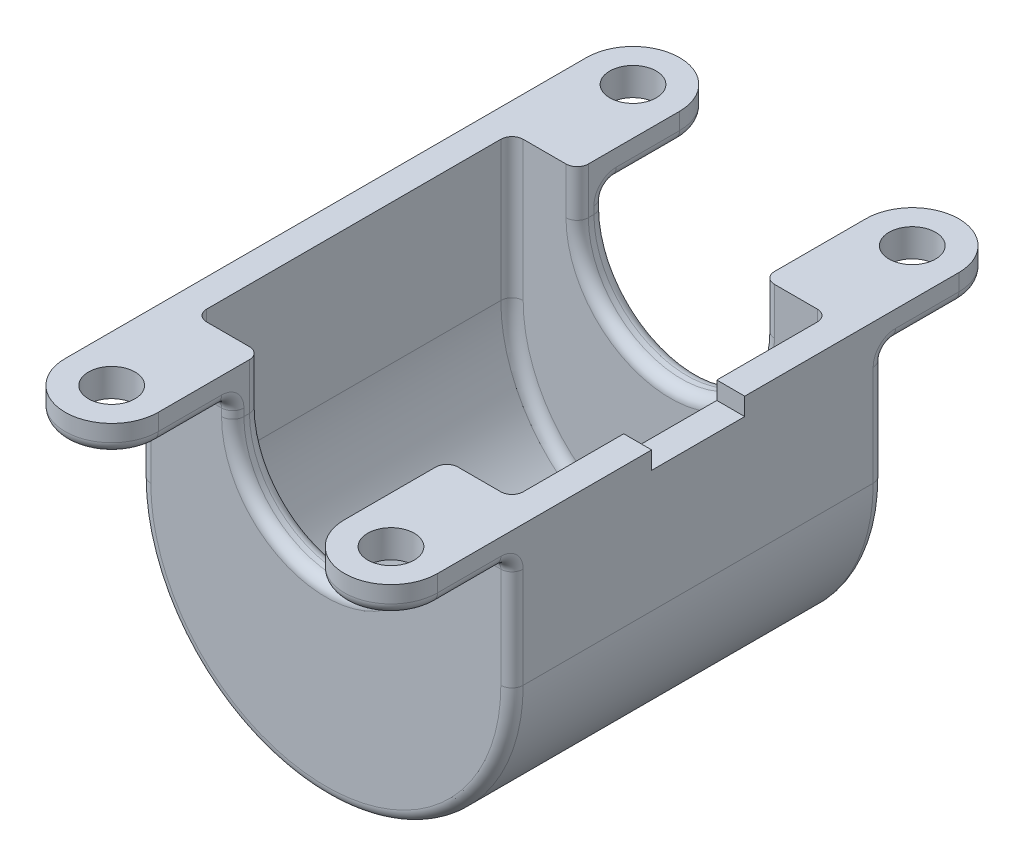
ISO-10303-21;
HEADER;
FILE_DESCRIPTION(('STEP AP214'),'2;1');
FILE_NAME('part.step','',(''),(''),'','','');
FILE_SCHEMA(('AUTOMOTIVE_DESIGN { 1 0 10303 214 1 1 1 1 }'));
ENDSEC;
DATA;
#1=APPLICATION_CONTEXT('core data for automotive mechanical design processes');
#2=APPLICATION_PROTOCOL_DEFINITION('international standard','automotive_design',2000,#1);
#3=PRODUCT_CONTEXT('',#1,'mechanical');
#4=PRODUCT('Part','Part','',(#3));
#5=PRODUCT_RELATED_PRODUCT_CATEGORY('part','',(#4));
#6=PRODUCT_DEFINITION_FORMATION('','',#4);
#7=PRODUCT_DEFINITION_CONTEXT('part definition',#1,'design');
#8=PRODUCT_DEFINITION('design','',#6,#7);
#9=PRODUCT_DEFINITION_SHAPE('','',#8);
#10=(LENGTH_UNIT() NAMED_UNIT(*) SI_UNIT(.MILLI.,.METRE.));
#11=(NAMED_UNIT(*) PLANE_ANGLE_UNIT() SI_UNIT($,.RADIAN.));
#12=(NAMED_UNIT(*) SI_UNIT($,.STERADIAN.) SOLID_ANGLE_UNIT());
#13=UNCERTAINTY_MEASURE_WITH_UNIT(LENGTH_MEASURE(1.E-05),#10,'distance_accuracy_value','');
#14=(GEOMETRIC_REPRESENTATION_CONTEXT(3) GLOBAL_UNCERTAINTY_ASSIGNED_CONTEXT((#13)) GLOBAL_UNIT_ASSIGNED_CONTEXT((#10,
#11,#12)) REPRESENTATION_CONTEXT('',''));
#15=CARTESIAN_POINT('',(0.,0.,0.));
#16=DIRECTION('',(0.,0.,1.));
#17=DIRECTION('',(1.,0.,0.));
#18=AXIS2_PLACEMENT_3D('',#15,#16,#17);
#19=CARTESIAN_POINT('',(50.8,38.1,50.8));
#20=DIRECTION('',(0.,-1.,0.));
#21=DIRECTION('',(0.,0.,-1.));
#22=AXIS2_PLACEMENT_3D('',#19,#20,#21);
#23=PLANE('',#22);
#24=CARTESIAN_POINT('',(38.1,38.1,71.12));
#25=DIRECTION('',(0.,-1.,0.));
#26=DIRECTION('',(0.,0.,1.));
#27=AXIS2_PLACEMENT_3D('',#24,#25,#26);
#28=CIRCLE('',#27,6.35);
#29=CARTESIAN_POINT('',(38.1,38.1,77.47));
#30=VERTEX_POINT('',#29);
#31=EDGE_CURVE('E431',#30,#30,#28,.T.);
#32=ORIENTED_EDGE('',*,*,#31,.T.);
#33=EDGE_LOOP('',(#32));
#34=FACE_BOUND('',#33,.T.);
#35=DIRECTION('',(-1.,0.,0.));
#36=VECTOR('',#35,1.);
#37=CARTESIAN_POINT('',(0.,38.1,43.18));
#38=LINE('',#37,#36);
#39=CARTESIAN_POINT('',(40.132,38.1,43.18));
#40=VERTEX_POINT('',#39);
#41=CARTESIAN_POINT('',(28.448,38.1,43.18));
#42=VERTEX_POINT('',#41);
#43=EDGE_CURVE('E671',#40,#42,#38,.T.);
#44=ORIENTED_EDGE('',*,*,#43,.T.);
#45=CARTESIAN_POINT('',(28.448,38.1,46.228));
#46=DIRECTION('',(0.,-1.,0.));
#47=DIRECTION('',(0.,0.,-1.));
#48=AXIS2_PLACEMENT_3D('',#45,#46,#47);
#49=CIRCLE('',#48,3.048);
#50=CARTESIAN_POINT('',(25.4,38.1,46.228));
#51=VERTEX_POINT('',#50);
#52=EDGE_CURVE('E641',#42,#51,#49,.F.);
#53=ORIENTED_EDGE('',*,*,#52,.T.);
#54=DIRECTION('',(0.,0.,-1.));
#55=VECTOR('',#54,1.);
#56=CARTESIAN_POINT('',(25.4,38.1,50.8));
#57=LINE('',#56,#55);
#58=CARTESIAN_POINT('',(25.4,38.1,71.12));
#59=VERTEX_POINT('',#58);
#60=EDGE_CURVE('E419',#59,#51,#57,.T.);
#61=ORIENTED_EDGE('',*,*,#60,.F.);
#62=CARTESIAN_POINT('',(38.1,38.1,71.12));
#63=DIRECTION('',(0.,-1.,0.));
#64=DIRECTION('',(0.,0.,-1.));
#65=AXIS2_PLACEMENT_3D('',#62,#63,#64);
#66=CIRCLE('',#65,12.7);
#67=CARTESIAN_POINT('',(50.8,38.1,71.12));
#68=VERTEX_POINT('',#67);
#69=EDGE_CURVE('E412',#68,#59,#66,.T.);
#70=ORIENTED_EDGE('',*,*,#69,.F.);
#71=DIRECTION('',(0.,0.,-1.));
#72=VECTOR('',#71,1.);
#73=CARTESIAN_POINT('',(50.8,38.1,50.8));
#74=LINE('',#73,#72);
#75=CARTESIAN_POINT('',(50.8,38.1,12.7));
#76=VERTEX_POINT('',#75);
#77=EDGE_CURVE('E402',#68,#76,#74,.T.);
#78=ORIENTED_EDGE('',*,*,#77,.T.);
#79=DIRECTION('',(1.,0.,0.));
#80=VECTOR('',#79,1.);
#81=CARTESIAN_POINT('',(-50.80105,38.1,12.7));
#82=LINE('',#81,#80);
#83=CARTESIAN_POINT('',(43.18,38.1,12.7));
#84=VERTEX_POINT('',#83);
#85=EDGE_CURVE('E383',#84,#76,#82,.T.);
#86=ORIENTED_EDGE('',*,*,#85,.F.);
#87=DIRECTION('',(0.,0.,-1.));
#88=VECTOR('',#87,1.);
#89=CARTESIAN_POINT('',(43.18,38.1,50.8));
#90=LINE('',#89,#88);
#91=CARTESIAN_POINT('',(43.18,38.1,40.132));
#92=VERTEX_POINT('',#91);
#93=EDGE_CURVE('E741',#92,#84,#90,.T.);
#94=ORIENTED_EDGE('',*,*,#93,.F.);
#95=CARTESIAN_POINT('',(40.132,38.1,40.132));
#96=DIRECTION('',(0.,-1.,0.));
#97=DIRECTION('',(0.,0.,-1.));
#98=AXIS2_PLACEMENT_3D('',#95,#96,#97);
#99=CIRCLE('',#98,3.048);
#100=EDGE_CURVE('E657',#92,#40,#99,.T.);
#101=ORIENTED_EDGE('',*,*,#100,.T.);
#102=EDGE_LOOP('',(#44,#53,#61,#70,#78,#86,#94,#101));
#103=FACE_BOUND('',#102,.T.);
#104=ADVANCED_FACE('F28',(#34,#103),#23,.F.);
#105=CARTESIAN_POINT('',(-50.8,38.1,50.8));
#106=DIRECTION('',(0.,-1.,0.));
#107=DIRECTION('',(0.,0.,-1.));
#108=AXIS2_PLACEMENT_3D('',#105,#106,#107);
#109=PLANE('',#108);
#110=DIRECTION('',(-1.,0.,0.));
#111=VECTOR('',#110,1.);
#112=CARTESIAN_POINT('',(0.,38.1,-43.18));
#113=LINE('',#112,#111);
#114=CARTESIAN_POINT('',(-28.448,38.1,-43.18));
#115=VERTEX_POINT('',#114);
#116=CARTESIAN_POINT('',(-40.132,38.1,-43.18));
#117=VERTEX_POINT('',#116);
#118=EDGE_CURVE('E665',#115,#117,#113,.T.);
#119=ORIENTED_EDGE('',*,*,#118,.F.);
#120=CARTESIAN_POINT('',(-28.448,38.1,-46.228));
#121=DIRECTION('',(0.,-1.,0.));
#122=DIRECTION('',(0.,0.,-1.));
#123=AXIS2_PLACEMENT_3D('',#120,#121,#122);
#124=CIRCLE('',#123,3.048);
#125=CARTESIAN_POINT('',(-25.4,38.1,-46.228));
#126=VERTEX_POINT('',#125);
#127=EDGE_CURVE('E639',#115,#126,#124,.F.);
#128=ORIENTED_EDGE('',*,*,#127,.T.);
#129=DIRECTION('',(0.,0.,-1.));
#130=VECTOR('',#129,1.);
#131=CARTESIAN_POINT('',(-25.4,38.1,50.8));
#132=LINE('',#131,#130);
#133=CARTESIAN_POINT('',(-25.4,38.1,-71.12));
#134=VERTEX_POINT('',#133);
#135=EDGE_CURVE('E758',#126,#134,#132,.T.);
#136=ORIENTED_EDGE('',*,*,#135,.T.);
#137=CARTESIAN_POINT('',(-38.1,38.1,-71.12));
#138=DIRECTION('',(0.,-1.,0.));
#139=DIRECTION('',(0.,0.,1.));
#140=AXIS2_PLACEMENT_3D('',#137,#138,#139);
#141=CIRCLE('',#140,12.7);
#142=CARTESIAN_POINT('',(-50.8,38.1,-71.12));
#143=VERTEX_POINT('',#142);
#144=EDGE_CURVE('E440',#143,#134,#141,.T.);
#145=ORIENTED_EDGE('',*,*,#144,.F.);
#146=DIRECTION('',(0.,0.,-1.));
#147=VECTOR('',#146,1.);
#148=CARTESIAN_POINT('',(-50.8,38.1,50.8));
#149=LINE('',#148,#147);
#150=CARTESIAN_POINT('',(-50.8,38.1,71.12));
#151=VERTEX_POINT('',#150);
#152=EDGE_CURVE('E754',#151,#143,#149,.T.);
#153=ORIENTED_EDGE('',*,*,#152,.F.);
#154=CARTESIAN_POINT('',(-38.1,38.1,71.12));
#155=DIRECTION('',(0.,1.,0.));
#156=DIRECTION('',(0.,0.,-1.));
#157=AXIS2_PLACEMENT_3D('',#154,#155,#156);
#158=CIRCLE('',#157,12.7);
#159=CARTESIAN_POINT('',(-25.4,38.1,71.12));
#160=VERTEX_POINT('',#159);
#161=EDGE_CURVE('E426',#151,#160,#158,.T.);
#162=ORIENTED_EDGE('',*,*,#161,.T.);
#163=CARTESIAN_POINT('',(-25.4,38.1,46.228));
#164=VERTEX_POINT('',#163);
#165=EDGE_CURVE('E759',#160,#164,#132,.T.);
#166=ORIENTED_EDGE('',*,*,#165,.T.);
#167=CARTESIAN_POINT('',(-28.448,38.1,46.228));
#168=DIRECTION('',(0.,-1.,0.));
#169=DIRECTION('',(0.,0.,-1.));
#170=AXIS2_PLACEMENT_3D('',#167,#168,#169);
#171=CIRCLE('',#170,3.048);
#172=CARTESIAN_POINT('',(-28.448,38.1,43.18));
#173=VERTEX_POINT('',#172);
#174=EDGE_CURVE('E637',#164,#173,#171,.F.);
#175=ORIENTED_EDGE('',*,*,#174,.T.);
#176=DIRECTION('',(-1.,0.,0.));
#177=VECTOR('',#176,1.);
#178=CARTESIAN_POINT('',(0.,38.1,43.18));
#179=LINE('',#178,#177);
#180=CARTESIAN_POINT('',(-40.132,38.1,43.18));
#181=VERTEX_POINT('',#180);
#182=EDGE_CURVE('E747',#173,#181,#179,.T.);
#183=ORIENTED_EDGE('',*,*,#182,.T.);
#184=CARTESIAN_POINT('',(-40.132,38.1,40.132));
#185=DIRECTION('',(0.,-1.,0.));
#186=DIRECTION('',(0.,0.,-1.));
#187=AXIS2_PLACEMENT_3D('',#184,#185,#186);
#188=CIRCLE('',#187,3.048);
#189=CARTESIAN_POINT('',(-43.18,38.1,40.132));
#190=VERTEX_POINT('',#189);
#191=EDGE_CURVE('E655',#181,#190,#188,.T.);
#192=ORIENTED_EDGE('',*,*,#191,.T.);
#193=DIRECTION('',(0.,0.,-1.));
#194=VECTOR('',#193,1.);
#195=CARTESIAN_POINT('',(-43.18,38.1,50.8));
#196=LINE('',#195,#194);
#197=CARTESIAN_POINT('',(-43.18,38.1,-40.132));
#198=VERTEX_POINT('',#197);
#199=EDGE_CURVE('E668',#190,#198,#196,.T.);
#200=ORIENTED_EDGE('',*,*,#199,.T.);
#201=CARTESIAN_POINT('',(-40.132,38.1,-40.132));
#202=DIRECTION('',(0.,-1.,0.));
#203=DIRECTION('',(0.,0.,-1.));
#204=AXIS2_PLACEMENT_3D('',#201,#202,#203);
#205=CIRCLE('',#204,3.048);
#206=EDGE_CURVE('E36',#198,#117,#205,.T.);
#207=ORIENTED_EDGE('',*,*,#206,.T.);
#208=EDGE_LOOP('',(#119,#128,#136,#145,#153,#162,#166,#175,#183,#192,#200,#207));
#209=FACE_BOUND('',#208,.T.);
#210=CARTESIAN_POINT('',(-38.1,38.1,71.12));
#211=DIRECTION('',(0.,1.,0.));
#212=DIRECTION('',(0.,0.,1.));
#213=AXIS2_PLACEMENT_3D('',#210,#211,#212);
#214=CIRCLE('',#213,6.35);
#215=CARTESIAN_POINT('',(-38.1,38.1,77.47));
#216=VERTEX_POINT('',#215);
#217=EDGE_CURVE('E427',#216,#216,#214,.T.);
#218=ORIENTED_EDGE('',*,*,#217,.F.);
#219=EDGE_LOOP('',(#218));
#220=FACE_BOUND('',#219,.T.);
#221=CARTESIAN_POINT('',(-38.1,38.1,-71.12));
#222=DIRECTION('',(0.,-1.,0.));
#223=DIRECTION('',(0.,0.,-1.));
#224=AXIS2_PLACEMENT_3D('',#221,#222,#223);
#225=CIRCLE('',#224,6.35);
#226=CARTESIAN_POINT('',(-38.1,38.1,-77.47));
#227=VERTEX_POINT('',#226);
#228=EDGE_CURVE('E441',#227,#227,#225,.T.);
#229=ORIENTED_EDGE('',*,*,#228,.T.);
#230=EDGE_LOOP('',(#229));
#231=FACE_BOUND('',#230,.T.);
#232=ADVANCED_FACE('F663',(#209,#220,#231),#109,.F.);
#233=CARTESIAN_POINT('',(-38.1,30.48,-71.12));
#234=DIRECTION('',(0.,-1.,0.));
#235=DIRECTION('',(0.,0.,1.));
#236=AXIS2_PLACEMENT_3D('',#233,#234,#235);
#237=PLANE('',#236);
#238=DIRECTION('',(-1.,0.,0.));
#239=VECTOR('',#238,1.);
#240=CARTESIAN_POINT('',(-50.8,30.48,-53.848));
#241=LINE('',#240,#239);
#242=CARTESIAN_POINT('',(-28.448,30.48,-53.848));
#243=VERTEX_POINT('',#242);
#244=CARTESIAN_POINT('',(-47.752,30.48,-53.848));
#245=VERTEX_POINT('',#244);
#246=EDGE_CURVE('E416',#243,#245,#241,.T.);
#247=ORIENTED_EDGE('',*,*,#246,.T.);
#248=DIRECTION('',(0.,0.,-1.));
#249=VECTOR('',#248,1.);
#250=CARTESIAN_POINT('',(-47.752,30.48,-71.12));
#251=LINE('',#250,#249);
#252=CARTESIAN_POINT('',(-47.752,30.48,-71.12));
#253=VERTEX_POINT('',#252);
#254=EDGE_CURVE('E547',#245,#253,#251,.T.);
#255=ORIENTED_EDGE('',*,*,#254,.T.);
#256=CARTESIAN_POINT('',(-38.1,30.48,-71.12));
#257=DIRECTION('',(0.,-1.,0.));
#258=DIRECTION('',(0.,0.,-1.));
#259=AXIS2_PLACEMENT_3D('',#256,#257,#258);
#260=CIRCLE('',#259,9.65200000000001);
#261=CARTESIAN_POINT('',(-28.448,30.48,-71.12));
#262=VERTEX_POINT('',#261);
#263=EDGE_CURVE('E545',#253,#262,#260,.T.);
#264=ORIENTED_EDGE('',*,*,#263,.T.);
#265=DIRECTION('',(0.,0.,1.));
#266=VECTOR('',#265,1.);
#267=CARTESIAN_POINT('',(-28.448,30.48,-53.848));
#268=LINE('',#267,#266);
#269=EDGE_CURVE('E543',#262,#243,#268,.T.);
#270=ORIENTED_EDGE('',*,*,#269,.T.);
#271=EDGE_LOOP('',(#247,#255,#264,#270));
#272=FACE_BOUND('',#271,.T.);
#273=CARTESIAN_POINT('',(-38.1,30.48,-71.12));
#274=DIRECTION('',(0.,-1.,0.));
#275=DIRECTION('',(0.,0.,-1.));
#276=AXIS2_PLACEMENT_3D('',#273,#274,#275);
#277=CIRCLE('',#276,6.35);
#278=CARTESIAN_POINT('',(-38.1,30.48,-77.47));
#279=VERTEX_POINT('',#278);
#280=EDGE_CURVE('E437',#279,#279,#277,.F.);
#281=ORIENTED_EDGE('',*,*,#280,.T.);
#282=EDGE_LOOP('',(#281));
#283=FACE_BOUND('',#282,.T.);
#284=ADVANCED_FACE('F697',(#272,#283),#237,.T.);
#285=CARTESIAN_POINT('',(0.,0.,-50.8));
#286=DIRECTION('',(0.,0.,-1.));
#287=DIRECTION('',(-1.,0.,0.));
#288=AXIS2_PLACEMENT_3D('',#285,#286,#287);
#289=PLANE('',#288);
#290=DIRECTION('',(1.,0.,0.));
#291=VECTOR('',#290,1.);
#292=CARTESIAN_POINT('',(50.8,27.432,-50.8));
#293=LINE('',#292,#291);
#294=CARTESIAN_POINT('',(28.448,27.432,-50.8));
#295=VERTEX_POINT('',#294);
#296=CARTESIAN_POINT('',(47.752,27.432,-50.8));
#297=VERTEX_POINT('',#296);
#298=EDGE_CURVE('E444',#295,#297,#293,.T.);
#299=ORIENTED_EDGE('',*,*,#298,.T.);
#300=DIRECTION('',(0.,1.,0.));
#301=VECTOR('',#300,1.);
#302=CARTESIAN_POINT('',(47.752,0.,-50.8));
#303=LINE('',#302,#301);
#304=CARTESIAN_POINT('',(47.752,0.,-50.8));
#305=VERTEX_POINT('',#304);
#306=EDGE_CURVE('E482',#297,#305,#303,.F.);
#307=ORIENTED_EDGE('',*,*,#306,.T.);
#308=CARTESIAN_POINT('',(0.,0.,-50.8));
#309=DIRECTION('',(0.,0.,-1.));
#310=DIRECTION('',(-1.,0.,0.));
#311=AXIS2_PLACEMENT_3D('',#308,#309,#310);
#312=CIRCLE('',#311,47.752);
#313=CARTESIAN_POINT('',(-47.752,0.,-50.8));
#314=VERTEX_POINT('',#313);
#315=EDGE_CURVE('E479',#305,#314,#312,.T.);
#316=ORIENTED_EDGE('',*,*,#315,.T.);
#317=DIRECTION('',(0.,-1.,0.));
#318=VECTOR('',#317,1.);
#319=CARTESIAN_POINT('',(-47.752,27.432,-50.8));
#320=LINE('',#319,#318);
#321=CARTESIAN_POINT('',(-47.752,27.432,-50.8));
#322=VERTEX_POINT('',#321);
#323=EDGE_CURVE('E477',#314,#322,#320,.F.);
#324=ORIENTED_EDGE('',*,*,#323,.T.);
#325=DIRECTION('',(-1.,0.,0.));
#326=VECTOR('',#325,1.);
#327=CARTESIAN_POINT('',(-25.4,27.432,-50.8));
#328=LINE('',#327,#326);
#329=CARTESIAN_POINT('',(-28.448,27.432,-50.8));
#330=VERTEX_POINT('',#329);
#331=EDGE_CURVE('E447',#322,#330,#328,.F.);
#332=ORIENTED_EDGE('',*,*,#331,.T.);
#333=DIRECTION('',(0.,1.,0.));
#334=VECTOR('',#333,1.);
#335=CARTESIAN_POINT('',(-28.448,25.4,-50.8));
#336=LINE('',#335,#334);
#337=CARTESIAN_POINT('',(-28.448,25.4,-50.8));
#338=VERTEX_POINT('',#337);
#339=EDGE_CURVE('E473',#330,#338,#336,.F.);
#340=ORIENTED_EDGE('',*,*,#339,.T.);
#341=CARTESIAN_POINT('',(0.,25.4,-50.8));
#342=DIRECTION('',(0.,0.,-1.));
#343=DIRECTION('',(-1.,0.,0.));
#344=AXIS2_PLACEMENT_3D('',#341,#342,#343);
#345=CIRCLE('',#344,28.448);
#346=CARTESIAN_POINT('',(28.448,25.4,-50.8));
#347=VERTEX_POINT('',#346);
#348=EDGE_CURVE('E471',#338,#347,#345,.F.);
#349=ORIENTED_EDGE('',*,*,#348,.T.);
#350=DIRECTION('',(0.,-1.,0.));
#351=VECTOR('',#350,1.);
#352=CARTESIAN_POINT('',(28.448,27.432,-50.8));
#353=LINE('',#352,#351);
#354=EDGE_CURVE('E475',#347,#295,#353,.F.);
#355=ORIENTED_EDGE('',*,*,#354,.T.);
#356=EDGE_LOOP('',(#299,#307,#316,#324,#332,#340,#349,#355));
#357=FACE_BOUND('',#356,.T.);
#358=ADVANCED_FACE('F703',(#357),#289,.T.);
#359=CARTESIAN_POINT('',(38.1,38.1,-71.12));
#360=DIRECTION('',(0.,1.,0.));
#361=DIRECTION('',(0.,0.,-1.));
#362=AXIS2_PLACEMENT_3D('',#359,#360,#361);
#363=CIRCLE('',#362,6.35);
#364=CARTESIAN_POINT('',(38.1,38.1,-77.47));
#365=VERTEX_POINT('',#364);
#366=EDGE_CURVE('E436',#365,#365,#363,.T.);
#367=ORIENTED_EDGE('',*,*,#366,.F.);
#368=EDGE_LOOP('',(#367));
#369=FACE_BOUND('',#368,.T.);
#370=CARTESIAN_POINT('',(25.4,38.1,-46.228));
#371=VERTEX_POINT('',#370);
#372=CARTESIAN_POINT('',(25.4,38.1,-71.12));
#373=VERTEX_POINT('',#372);
#374=EDGE_CURVE('E719',#371,#373,#57,.T.);
#375=ORIENTED_EDGE('',*,*,#374,.F.);
#376=CARTESIAN_POINT('',(28.448,38.1,-46.228));
#377=DIRECTION('',(0.,-1.,0.));
#378=DIRECTION('',(0.,0.,-1.));
#379=AXIS2_PLACEMENT_3D('',#376,#377,#378);
#380=CIRCLE('',#379,3.048);
#381=CARTESIAN_POINT('',(28.448,38.1,-43.18));
#382=VERTEX_POINT('',#381);
#383=EDGE_CURVE('E635',#371,#382,#380,.F.);
#384=ORIENTED_EDGE('',*,*,#383,.T.);
#385=DIRECTION('',(-1.,0.,0.));
#386=VECTOR('',#385,1.);
#387=CARTESIAN_POINT('',(0.,38.1,-43.18));
#388=LINE('',#387,#386);
#389=CARTESIAN_POINT('',(40.132,38.1,-43.18));
#390=VERTEX_POINT('',#389);
#391=EDGE_CURVE('E672',#390,#382,#388,.T.);
#392=ORIENTED_EDGE('',*,*,#391,.F.);
#393=CARTESIAN_POINT('',(40.132,38.1,-40.132));
#394=DIRECTION('',(0.,-1.,0.));
#395=DIRECTION('',(0.,0.,-1.));
#396=AXIS2_PLACEMENT_3D('',#393,#394,#395);
#397=CIRCLE('',#396,3.048);
#398=CARTESIAN_POINT('',(43.18,38.1,-40.132));
#399=VERTEX_POINT('',#398);
#400=EDGE_CURVE('E11',#390,#399,#397,.T.);
#401=ORIENTED_EDGE('',*,*,#400,.T.);
#402=CARTESIAN_POINT('',(43.18,38.1,-12.7));
#403=VERTEX_POINT('',#402);
#404=EDGE_CURVE('E745',#403,#399,#90,.T.);
#405=ORIENTED_EDGE('',*,*,#404,.F.);
#406=DIRECTION('',(1.,0.,0.));
#407=VECTOR('',#406,1.);
#408=CARTESIAN_POINT('',(-50.80105,38.1,-12.7));
#409=LINE('',#408,#407);
#410=CARTESIAN_POINT('',(50.8,38.1,-12.7));
#411=VERTEX_POINT('',#410);
#412=EDGE_CURVE('E804',#403,#411,#409,.T.);
#413=ORIENTED_EDGE('',*,*,#412,.T.);
#414=CARTESIAN_POINT('',(50.8,38.1,-71.12));
#415=VERTEX_POINT('',#414);
#416=EDGE_CURVE('E414',#411,#415,#74,.T.);
#417=ORIENTED_EDGE('',*,*,#416,.T.);
#418=CARTESIAN_POINT('',(38.1,38.1,-71.12));
#419=DIRECTION('',(0.,1.,0.));
#420=DIRECTION('',(0.,0.,1.));
#421=AXIS2_PLACEMENT_3D('',#418,#419,#420);
#422=CIRCLE('',#421,12.7);
#423=EDGE_CURVE('E435',#415,#373,#422,.T.);
#424=ORIENTED_EDGE('',*,*,#423,.T.);
#425=EDGE_LOOP('',(#375,#384,#392,#401,#405,#413,#417,#424));
#426=FACE_BOUND('',#425,.T.);
#427=ADVANCED_FACE('F692',(#369,#426),#23,.F.);
#428=CARTESIAN_POINT('',(38.1,30.48,71.12));
#429=DIRECTION('',(0.,-1.,0.));
#430=DIRECTION('',(0.,0.,-1.));
#431=AXIS2_PLACEMENT_3D('',#428,#429,#430);
#432=PLANE('',#431);
#433=DIRECTION('',(1.,0.,0.));
#434=VECTOR('',#433,1.);
#435=CARTESIAN_POINT('',(38.1,30.48,53.848));
#436=LINE('',#435,#434);
#437=CARTESIAN_POINT('',(28.448,30.48,53.848));
#438=VERTEX_POINT('',#437);
#439=CARTESIAN_POINT('',(47.752,30.48,53.848));
#440=VERTEX_POINT('',#439);
#441=EDGE_CURVE('E453',#438,#440,#436,.T.);
#442=ORIENTED_EDGE('',*,*,#441,.T.);
#443=DIRECTION('',(0.,0.,1.));
#444=VECTOR('',#443,1.);
#445=CARTESIAN_POINT('',(47.752,30.48,71.12));
#446=LINE('',#445,#444);
#447=CARTESIAN_POINT('',(47.752,30.48,71.12));
#448=VERTEX_POINT('',#447);
#449=EDGE_CURVE('E553',#440,#448,#446,.T.);
#450=ORIENTED_EDGE('',*,*,#449,.T.);
#451=CARTESIAN_POINT('',(38.1,30.48,71.12));
#452=DIRECTION('',(0.,-1.,0.));
#453=DIRECTION('',(0.,0.,-1.));
#454=AXIS2_PLACEMENT_3D('',#451,#452,#453);
#455=CIRCLE('',#454,9.65200000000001);
#456=CARTESIAN_POINT('',(28.448,30.48,71.12));
#457=VERTEX_POINT('',#456);
#458=EDGE_CURVE('E551',#448,#457,#455,.T.);
#459=ORIENTED_EDGE('',*,*,#458,.T.);
#460=DIRECTION('',(0.,0.,-1.));
#461=VECTOR('',#460,1.);
#462=CARTESIAN_POINT('',(28.448,30.48,53.848));
#463=LINE('',#462,#461);
#464=EDGE_CURVE('E549',#457,#438,#463,.T.);
#465=ORIENTED_EDGE('',*,*,#464,.T.);
#466=EDGE_LOOP('',(#442,#450,#459,#465));
#467=FACE_BOUND('',#466,.T.);
#468=CARTESIAN_POINT('',(38.1,30.48,71.12));
#469=DIRECTION('',(0.,-1.,0.));
#470=DIRECTION('',(0.,0.,-1.));
#471=AXIS2_PLACEMENT_3D('',#468,#469,#470);
#472=CIRCLE('',#471,6.35);
#473=CARTESIAN_POINT('',(38.1,30.48,64.77));
#474=VERTEX_POINT('',#473);
#475=EDGE_CURVE('E428',#474,#474,#472,.F.);
#476=ORIENTED_EDGE('',*,*,#475,.T.);
#477=EDGE_LOOP('',(#476));
#478=FACE_BOUND('',#477,.T.);
#479=ADVANCED_FACE('F702',(#467,#478),#432,.T.);
#480=CARTESIAN_POINT('',(25.4,38.1,50.8));
#481=DIRECTION('',(1.,0.,0.));
#482=DIRECTION('',(0.,1.,0.));
#483=AXIS2_PLACEMENT_3D('',#480,#481,#482);
#484=PLANE('',#483);
#485=DIRECTION('',(0.,1.,0.));
#486=VECTOR('',#485,1.);
#487=CARTESIAN_POINT('',(25.4,30.48,-71.12));
#488=LINE('',#487,#486);
#489=CARTESIAN_POINT('',(25.4,33.528,-71.12));
#490=VERTEX_POINT('',#489);
#491=EDGE_CURVE('E827',#490,#373,#488,.T.);
#492=ORIENTED_EDGE('',*,*,#491,.F.);
#493=DIRECTION('',(0.,0.,1.));
#494=VECTOR('',#493,1.);
#495=CARTESIAN_POINT('',(25.4,33.528,-53.848));
#496=LINE('',#495,#494);
#497=CARTESIAN_POINT('',(25.4,33.528,-53.848));
#498=VERTEX_POINT('',#497);
#499=EDGE_CURVE('E575',#490,#498,#496,.T.);
#500=ORIENTED_EDGE('',*,*,#499,.T.);
#501=CARTESIAN_POINT('',(25.4,27.432,-53.848));
#502=DIRECTION('',(1.,0.,0.));
#503=DIRECTION('',(0.,1.,0.));
#504=AXIS2_PLACEMENT_3D('',#501,#502,#503);
#505=CIRCLE('',#504,6.096);
#506=CARTESIAN_POINT('',(25.4,27.432,-47.752));
#507=VERTEX_POINT('',#506);
#508=EDGE_CURVE('E573',#498,#507,#505,.T.);
#509=ORIENTED_EDGE('',*,*,#508,.T.);
#510=DIRECTION('',(0.,-1.,0.));
#511=VECTOR('',#510,1.);
#512=CARTESIAN_POINT('',(25.4,25.4,-47.752));
#513=LINE('',#512,#511);
#514=CARTESIAN_POINT('',(25.4,25.4,-47.752));
#515=VERTEX_POINT('',#514);
#516=EDGE_CURVE('E571',#507,#515,#513,.T.);
#517=ORIENTED_EDGE('',*,*,#516,.T.);
#518=DIRECTION('',(0.,0.,-1.));
#519=VECTOR('',#518,1.);
#520=CARTESIAN_POINT('',(25.4,25.4,50.8));
#521=LINE('',#520,#519);
#522=CARTESIAN_POINT('',(25.4,25.4,-46.228));
#523=VERTEX_POINT('',#522);
#524=EDGE_CURVE('E765',#523,#515,#521,.T.);
#525=ORIENTED_EDGE('',*,*,#524,.F.);
#526=DIRECTION('',(0.,-1.,0.));
#527=VECTOR('',#526,1.);
#528=CARTESIAN_POINT('',(25.4,38.1,-46.228));
#529=LINE('',#528,#527);
#530=EDGE_CURVE('E569',#523,#371,#529,.F.);
#531=ORIENTED_EDGE('',*,*,#530,.T.);
#532=ORIENTED_EDGE('',*,*,#374,.T.);
#533=EDGE_LOOP('',(#492,#500,#509,#517,#525,#531,#532));
#534=FACE_BOUND('',#533,.T.);
#535=ADVANCED_FACE('F709',(#534),#484,.F.);
#536=CARTESIAN_POINT('',(0.,25.4,50.8));
#537=DIRECTION('',(0.,0.,-1.));
#538=DIRECTION('',(-1.,0.,0.));
#539=AXIS2_PLACEMENT_3D('',#536,#537,#538);
#540=CYLINDRICAL_SURFACE('',#539,25.4);
#541=ORIENTED_EDGE('',*,*,#524,.T.);
#542=CARTESIAN_POINT('',(0.,25.4,-47.752));
#543=DIRECTION('',(0.,0.,-1.));
#544=DIRECTION('',(-1.,0.,0.));
#545=AXIS2_PLACEMENT_3D('',#542,#543,#544);
#546=CIRCLE('',#545,25.4);
#547=CARTESIAN_POINT('',(-25.4,25.4,-47.752));
#548=VERTEX_POINT('',#547);
#549=EDGE_CURVE('E649',#515,#548,#546,.T.);
#550=ORIENTED_EDGE('',*,*,#549,.T.);
#551=DIRECTION('',(0.,0.,-1.));
#552=VECTOR('',#551,1.);
#553=CARTESIAN_POINT('',(-25.4,25.4,50.8));
#554=LINE('',#553,#552);
#555=CARTESIAN_POINT('',(-25.4,25.4,-46.228));
#556=VERTEX_POINT('',#555);
#557=EDGE_CURVE('E762',#556,#548,#554,.T.);
#558=ORIENTED_EDGE('',*,*,#557,.F.);
#559=CARTESIAN_POINT('',(0.,25.4,-46.228));
#560=DIRECTION('',(0.,0.,-1.));
#561=DIRECTION('',(-1.,0.,0.));
#562=AXIS2_PLACEMENT_3D('',#559,#560,#561);
#563=CIRCLE('',#562,25.4);
#564=EDGE_CURVE('E647',#556,#523,#563,.F.);
#565=ORIENTED_EDGE('',*,*,#564,.T.);
#566=EDGE_LOOP('',(#541,#550,#558,#565));
#567=FACE_BOUND('',#566,.T.);
#568=ADVANCED_FACE('F773',(#567),#540,.F.);
#569=CARTESIAN_POINT('',(-25.4,38.1,50.8));
#570=DIRECTION('',(-1.,0.,0.));
#571=DIRECTION('',(0.,-1.,0.));
#572=AXIS2_PLACEMENT_3D('',#569,#570,#571);
#573=PLANE('',#572);
#574=CARTESIAN_POINT('',(-25.4,27.432,-53.848));
#575=DIRECTION('',(-1.,0.,0.));
#576=DIRECTION('',(0.,-1.,0.));
#577=AXIS2_PLACEMENT_3D('',#574,#575,#576);
#578=CIRCLE('',#577,6.096);
#579=CARTESIAN_POINT('',(-25.4,27.432,-47.752));
#580=VERTEX_POINT('',#579);
#581=CARTESIAN_POINT('',(-25.4,33.528,-53.848));
#582=VERTEX_POINT('',#581);
#583=EDGE_CURVE('E581',#580,#582,#578,.T.);
#584=ORIENTED_EDGE('',*,*,#583,.T.);
#585=DIRECTION('',(0.,0.,1.));
#586=VECTOR('',#585,1.);
#587=CARTESIAN_POINT('',(-25.4,33.528,-71.12));
#588=LINE('',#587,#586);
#589=CARTESIAN_POINT('',(-25.4,33.528,-71.12));
#590=VERTEX_POINT('',#589);
#591=EDGE_CURVE('E583',#582,#590,#588,.F.);
#592=ORIENTED_EDGE('',*,*,#591,.T.);
#593=DIRECTION('',(0.,1.,0.));
#594=VECTOR('',#593,1.);
#595=CARTESIAN_POINT('',(-25.4,30.48,-71.12));
#596=LINE('',#595,#594);
#597=EDGE_CURVE('E819',#590,#134,#596,.T.);
#598=ORIENTED_EDGE('',*,*,#597,.T.);
#599=ORIENTED_EDGE('',*,*,#135,.F.);
#600=DIRECTION('',(0.,1.,0.));
#601=VECTOR('',#600,1.);
#602=CARTESIAN_POINT('',(-25.4,38.1,-46.228));
#603=LINE('',#602,#601);
#604=EDGE_CURVE('E577',#126,#556,#603,.F.);
#605=ORIENTED_EDGE('',*,*,#604,.T.);
#606=ORIENTED_EDGE('',*,*,#557,.T.);
#607=DIRECTION('',(0.,1.,0.));
#608=VECTOR('',#607,1.);
#609=CARTESIAN_POINT('',(-25.4,27.432,-47.752));
#610=LINE('',#609,#608);
#611=EDGE_CURVE('E579',#548,#580,#610,.T.);
#612=ORIENTED_EDGE('',*,*,#611,.T.);
#613=EDGE_LOOP('',(#584,#592,#598,#599,#605,#606,#612));
#614=FACE_BOUND('',#613,.T.);
#615=ADVANCED_FACE('F975',(#614),#573,.F.);
#616=CARTESIAN_POINT('',(0.,0.,50.8));
#617=DIRECTION('',(0.,0.,-1.));
#618=DIRECTION('',(-1.,0.,0.));
#619=AXIS2_PLACEMENT_3D('',#616,#617,#618);
#620=CYLINDRICAL_SURFACE('',#619,50.8);
#621=DIRECTION('',(0.,0.,-1.));
#622=VECTOR('',#621,1.);
#623=CARTESIAN_POINT('',(-50.8,0.,50.8));
#624=LINE('',#623,#622);
#625=CARTESIAN_POINT('',(-50.8,0.,47.752));
#626=VERTEX_POINT('',#625);
#627=CARTESIAN_POINT('',(-50.8,0.,-47.752));
#628=VERTEX_POINT('',#627);
#629=EDGE_CURVE('E751',#626,#628,#624,.T.);
#630=ORIENTED_EDGE('',*,*,#629,.T.);
#631=CARTESIAN_POINT('',(0.,0.,-47.752));
#632=DIRECTION('',(0.,0.,-1.));
#633=DIRECTION('',(-1.,0.,0.));
#634=AXIS2_PLACEMENT_3D('',#631,#632,#633);
#635=CIRCLE('',#634,50.8);
#636=CARTESIAN_POINT('',(50.8,0.,-47.752));
#637=VERTEX_POINT('',#636);
#638=EDGE_CURVE('E468',#628,#637,#635,.F.);
#639=ORIENTED_EDGE('',*,*,#638,.T.);
#640=DIRECTION('',(0.,0.,-1.));
#641=VECTOR('',#640,1.);
#642=CARTESIAN_POINT('',(50.8,0.,50.8));
#643=LINE('',#642,#641);
#644=CARTESIAN_POINT('',(50.8,0.,47.752));
#645=VERTEX_POINT('',#644);
#646=EDGE_CURVE('E413',#645,#637,#643,.T.);
#647=ORIENTED_EDGE('',*,*,#646,.F.);
#648=CARTESIAN_POINT('',(0.,0.,47.752));
#649=DIRECTION('',(0.,0.,-1.));
#650=DIRECTION('',(-1.,0.,0.));
#651=AXIS2_PLACEMENT_3D('',#648,#649,#650);
#652=CIRCLE('',#651,50.8);
#653=EDGE_CURVE('E465',#645,#626,#652,.T.);
#654=ORIENTED_EDGE('',*,*,#653,.T.);
#655=EDGE_LOOP('',(#630,#639,#647,#654));
#656=FACE_BOUND('',#655,.T.);
#657=ADVANCED_FACE('F30',(#656),#620,.T.);
#658=CARTESIAN_POINT('',(50.8,0.,50.8));
#659=DIRECTION('',(-1.,0.,0.));
#660=DIRECTION('',(0.,-1.,0.));
#661=AXIS2_PLACEMENT_3D('',#658,#659,#660);
#662=PLANE('',#661);
#663=ORIENTED_EDGE('',*,*,#646,.T.);
#664=DIRECTION('',(0.,1.,0.));
#665=VECTOR('',#664,1.);
#666=CARTESIAN_POINT('',(50.8,27.432,-47.752));
#667=LINE('',#666,#665);
#668=CARTESIAN_POINT('',(50.8,27.432,-47.752));
#669=VERTEX_POINT('',#668);
#670=EDGE_CURVE('E507',#637,#669,#667,.T.);
#671=ORIENTED_EDGE('',*,*,#670,.T.);
#672=CARTESIAN_POINT('',(50.8,27.432,-53.848));
#673=DIRECTION('',(-1.,0.,0.));
#674=DIRECTION('',(0.,-1.,0.));
#675=AXIS2_PLACEMENT_3D('',#672,#673,#674);
#676=CIRCLE('',#675,6.096);
#677=CARTESIAN_POINT('',(50.8,33.528,-53.848));
#678=VERTEX_POINT('',#677);
#679=EDGE_CURVE('E505',#669,#678,#676,.T.);
#680=ORIENTED_EDGE('',*,*,#679,.T.);
#681=DIRECTION('',(0.,0.,-1.));
#682=VECTOR('',#681,1.);
#683=CARTESIAN_POINT('',(50.8,33.528,-71.12));
#684=LINE('',#683,#682);
#685=CARTESIAN_POINT('',(50.8,33.528,-71.12));
#686=VERTEX_POINT('',#685);
#687=EDGE_CURVE('E503',#678,#686,#684,.T.);
#688=ORIENTED_EDGE('',*,*,#687,.T.);
#689=DIRECTION('',(0.,1.,0.));
#690=VECTOR('',#689,1.);
#691=CARTESIAN_POINT('',(50.8,30.48,-71.12));
#692=LINE('',#691,#690);
#693=EDGE_CURVE('E826',#686,#415,#692,.T.);
#694=ORIENTED_EDGE('',*,*,#693,.T.);
#695=ORIENTED_EDGE('',*,*,#416,.F.);
#696=DIRECTION('',(0.,1.,0.));
#697=VECTOR('',#696,1.);
#698=CARTESIAN_POINT('',(50.8,38.1,-12.7));
#699=LINE('',#698,#697);
#700=CARTESIAN_POINT('',(50.8,33.274,-12.7));
#701=VERTEX_POINT('',#700);
#702=EDGE_CURVE('E805',#701,#411,#699,.T.);
#703=ORIENTED_EDGE('',*,*,#702,.F.);
#704=DIRECTION('',(0.,0.,-1.));
#705=VECTOR('',#704,1.);
#706=CARTESIAN_POINT('',(50.8,33.274,12.7));
#707=LINE('',#706,#705);
#708=CARTESIAN_POINT('',(50.8,33.274,12.7));
#709=VERTEX_POINT('',#708);
#710=EDGE_CURVE('E406',#709,#701,#707,.T.);
#711=ORIENTED_EDGE('',*,*,#710,.F.);
#712=DIRECTION('',(0.,-1.,0.));
#713=VECTOR('',#712,1.);
#714=CARTESIAN_POINT('',(50.8,38.1,12.7));
#715=LINE('',#714,#713);
#716=EDGE_CURVE('E387',#76,#709,#715,.T.);
#717=ORIENTED_EDGE('',*,*,#716,.F.);
#718=ORIENTED_EDGE('',*,*,#77,.F.);
#719=DIRECTION('',(0.,1.,0.));
#720=VECTOR('',#719,1.);
#721=CARTESIAN_POINT('',(50.8,30.48,71.12));
#722=LINE('',#721,#720);
#723=CARTESIAN_POINT('',(50.8,33.528,71.12));
#724=VERTEX_POINT('',#723);
#725=EDGE_CURVE('E833',#724,#68,#722,.T.);
#726=ORIENTED_EDGE('',*,*,#725,.F.);
#727=DIRECTION('',(0.,0.,1.));
#728=VECTOR('',#727,1.);
#729=CARTESIAN_POINT('',(50.8,33.528,53.848));
#730=LINE('',#729,#728);
#731=CARTESIAN_POINT('',(50.8,33.528,53.848));
#732=VERTEX_POINT('',#731);
#733=EDGE_CURVE('E497',#724,#732,#730,.F.);
#734=ORIENTED_EDGE('',*,*,#733,.T.);
#735=CARTESIAN_POINT('',(50.8,27.432,53.848));
#736=DIRECTION('',(-1.,0.,0.));
#737=DIRECTION('',(0.,-1.,0.));
#738=AXIS2_PLACEMENT_3D('',#735,#736,#737);
#739=CIRCLE('',#738,6.096);
#740=CARTESIAN_POINT('',(50.8,27.432,47.752));
#741=VERTEX_POINT('',#740);
#742=EDGE_CURVE('E499',#732,#741,#739,.T.);
#743=ORIENTED_EDGE('',*,*,#742,.T.);
#744=DIRECTION('',(0.,1.,0.));
#745=VECTOR('',#744,1.);
#746=CARTESIAN_POINT('',(50.8,0.,47.752));
#747=LINE('',#746,#745);
#748=EDGE_CURVE('E501',#741,#645,#747,.F.);
#749=ORIENTED_EDGE('',*,*,#748,.T.);
#750=EDGE_LOOP('',(#663,#671,#680,#688,#694,#695,#703,#711,#717,#718,#726,#734,#743,#749));
#751=FACE_BOUND('',#750,.T.);
#752=ADVANCED_FACE('F400',(#751),#662,.F.);
#753=CARTESIAN_POINT('',(25.4,27.432,53.848));
#754=DIRECTION('',(1.,0.,0.));
#755=DIRECTION('',(0.,1.,0.));
#756=AXIS2_PLACEMENT_3D('',#753,#754,#755);
#757=CIRCLE('',#756,6.096);
#758=CARTESIAN_POINT('',(25.4,27.432,47.752));
#759=VERTEX_POINT('',#758);
#760=CARTESIAN_POINT('',(25.4,33.528,53.848));
#761=VERTEX_POINT('',#760);
#762=EDGE_CURVE('E590',#759,#761,#757,.T.);
#763=ORIENTED_EDGE('',*,*,#762,.T.);
#764=DIRECTION('',(0.,0.,-1.));
#765=VECTOR('',#764,1.);
#766=CARTESIAN_POINT('',(25.4,33.528,71.12));
#767=LINE('',#766,#765);
#768=CARTESIAN_POINT('',(25.4,33.528,71.12));
#769=VERTEX_POINT('',#768);
#770=EDGE_CURVE('E592',#761,#769,#767,.F.);
#771=ORIENTED_EDGE('',*,*,#770,.T.);
#772=DIRECTION('',(0.,1.,0.));
#773=VECTOR('',#772,1.);
#774=CARTESIAN_POINT('',(25.4,30.48,71.12));
#775=LINE('',#774,#773);
#776=EDGE_CURVE('E832',#769,#59,#775,.T.);
#777=ORIENTED_EDGE('',*,*,#776,.T.);
#778=ORIENTED_EDGE('',*,*,#60,.T.);
#779=DIRECTION('',(0.,-1.,0.));
#780=VECTOR('',#779,1.);
#781=CARTESIAN_POINT('',(25.4,25.4,46.228));
#782=LINE('',#781,#780);
#783=CARTESIAN_POINT('',(25.4,25.4,46.228));
#784=VERTEX_POINT('',#783);
#785=EDGE_CURVE('E585',#51,#784,#782,.T.);
#786=ORIENTED_EDGE('',*,*,#785,.T.);
#787=CARTESIAN_POINT('',(25.4,25.4,47.752));
#788=VERTEX_POINT('',#787);
#789=EDGE_CURVE('E727',#788,#784,#521,.T.);
#790=ORIENTED_EDGE('',*,*,#789,.F.);
#791=DIRECTION('',(0.,-1.,0.));
#792=VECTOR('',#791,1.);
#793=CARTESIAN_POINT('',(25.4,38.1,47.752));
#794=LINE('',#793,#792);
#795=EDGE_CURVE('E588',#788,#759,#794,.F.);
#796=ORIENTED_EDGE('',*,*,#795,.T.);
#797=EDGE_LOOP('',(#763,#771,#777,#778,#786,#790,#796));
#798=FACE_BOUND('',#797,.T.);
#799=ADVANCED_FACE('F1000',(#798),#484,.F.);
#800=CARTESIAN_POINT('',(-25.4,25.4,47.752));
#801=VERTEX_POINT('',#800);
#802=CARTESIAN_POINT('',(-25.4,25.4,46.228));
#803=VERTEX_POINT('',#802);
#804=EDGE_CURVE('E763',#801,#803,#554,.T.);
#805=ORIENTED_EDGE('',*,*,#804,.F.);
#806=CARTESIAN_POINT('',(0.,25.4,47.752));
#807=DIRECTION('',(0.,0.,-1.));
#808=DIRECTION('',(-1.,0.,0.));
#809=AXIS2_PLACEMENT_3D('',#806,#807,#808);
#810=CIRCLE('',#809,25.4);
#811=EDGE_CURVE('E653',#801,#788,#810,.F.);
#812=ORIENTED_EDGE('',*,*,#811,.T.);
#813=ORIENTED_EDGE('',*,*,#789,.T.);
#814=CARTESIAN_POINT('',(0.,25.4,46.228));
#815=DIRECTION('',(0.,0.,-1.));
#816=DIRECTION('',(-1.,0.,0.));
#817=AXIS2_PLACEMENT_3D('',#814,#815,#816);
#818=CIRCLE('',#817,25.4);
#819=EDGE_CURVE('E651',#784,#803,#818,.T.);
#820=ORIENTED_EDGE('',*,*,#819,.T.);
#821=EDGE_LOOP('',(#805,#812,#813,#820));
#822=FACE_BOUND('',#821,.T.);
#823=ADVANCED_FACE('F1087',(#822),#540,.F.);
#824=DIRECTION('',(0.,1.,0.));
#825=VECTOR('',#824,1.);
#826=CARTESIAN_POINT('',(-25.4,30.48,71.12));
#827=LINE('',#826,#825);
#828=CARTESIAN_POINT('',(-25.4,33.528,71.12));
#829=VERTEX_POINT('',#828);
#830=EDGE_CURVE('E736',#829,#160,#827,.T.);
#831=ORIENTED_EDGE('',*,*,#830,.F.);
#832=DIRECTION('',(0.,0.,-1.));
#833=VECTOR('',#832,1.);
#834=CARTESIAN_POINT('',(-25.4,33.528,53.848));
#835=LINE('',#834,#833);
#836=CARTESIAN_POINT('',(-25.4,33.528,53.848));
#837=VERTEX_POINT('',#836);
#838=EDGE_CURVE('E600',#829,#837,#835,.T.);
#839=ORIENTED_EDGE('',*,*,#838,.T.);
#840=CARTESIAN_POINT('',(-25.4,27.432,53.848));
#841=DIRECTION('',(-1.,0.,0.));
#842=DIRECTION('',(0.,-1.,0.));
#843=AXIS2_PLACEMENT_3D('',#840,#841,#842);
#844=CIRCLE('',#843,6.096);
#845=CARTESIAN_POINT('',(-25.4,27.432,47.752));
#846=VERTEX_POINT('',#845);
#847=EDGE_CURVE('E598',#837,#846,#844,.T.);
#848=ORIENTED_EDGE('',*,*,#847,.T.);
#849=DIRECTION('',(0.,1.,0.));
#850=VECTOR('',#849,1.);
#851=CARTESIAN_POINT('',(-25.4,38.1,47.752));
#852=LINE('',#851,#850);
#853=EDGE_CURVE('E596',#846,#801,#852,.F.);
#854=ORIENTED_EDGE('',*,*,#853,.T.);
#855=ORIENTED_EDGE('',*,*,#804,.T.);
#856=DIRECTION('',(0.,1.,0.));
#857=VECTOR('',#856,1.);
#858=CARTESIAN_POINT('',(-25.4,38.1,46.228));
#859=LINE('',#858,#857);
#860=EDGE_CURVE('E594',#803,#164,#859,.T.);
#861=ORIENTED_EDGE('',*,*,#860,.T.);
#862=ORIENTED_EDGE('',*,*,#165,.F.);
#863=EDGE_LOOP('',(#831,#839,#848,#854,#855,#861,#862));
#864=FACE_BOUND('',#863,.T.);
#865=ADVANCED_FACE('F1074',(#864),#573,.F.);
#866=CARTESIAN_POINT('',(-50.8,0.,50.8));
#867=DIRECTION('',(1.,0.,0.));
#868=DIRECTION('',(0.,0.,-1.));
#869=AXIS2_PLACEMENT_3D('',#866,#867,#868);
#870=PLANE('',#869);
#871=CARTESIAN_POINT('',(-50.8,27.432,-53.848));
#872=DIRECTION('',(1.,0.,0.));
#873=DIRECTION('',(0.,0.,-1.));
#874=AXIS2_PLACEMENT_3D('',#871,#872,#873);
#875=CIRCLE('',#874,6.096);
#876=CARTESIAN_POINT('',(-50.8,33.528,-53.848));
#877=VERTEX_POINT('',#876);
#878=CARTESIAN_POINT('',(-50.8,27.432,-47.752));
#879=VERTEX_POINT('',#878);
#880=EDGE_CURVE('E517',#877,#879,#875,.T.);
#881=ORIENTED_EDGE('',*,*,#880,.T.);
#882=DIRECTION('',(0.,-1.,0.));
#883=VECTOR('',#882,1.);
#884=CARTESIAN_POINT('',(-50.8,0.,-47.752));
#885=LINE('',#884,#883);
#886=EDGE_CURVE('E519',#879,#628,#885,.T.);
#887=ORIENTED_EDGE('',*,*,#886,.T.);
#888=ORIENTED_EDGE('',*,*,#629,.F.);
#889=DIRECTION('',(0.,-1.,0.));
#890=VECTOR('',#889,1.);
#891=CARTESIAN_POINT('',(-50.8,0.,47.752));
#892=LINE('',#891,#890);
#893=CARTESIAN_POINT('',(-50.8,27.432,47.752));
#894=VERTEX_POINT('',#893);
#895=EDGE_CURVE('E513',#626,#894,#892,.F.);
#896=ORIENTED_EDGE('',*,*,#895,.T.);
#897=CARTESIAN_POINT('',(-50.8,27.432,53.848));
#898=DIRECTION('',(1.,0.,0.));
#899=DIRECTION('',(0.,0.,-1.));
#900=AXIS2_PLACEMENT_3D('',#897,#898,#899);
#901=CIRCLE('',#900,6.096);
#902=CARTESIAN_POINT('',(-50.8,33.528,53.848));
#903=VERTEX_POINT('',#902);
#904=EDGE_CURVE('E511',#894,#903,#901,.T.);
#905=ORIENTED_EDGE('',*,*,#904,.T.);
#906=DIRECTION('',(0.,0.,1.));
#907=VECTOR('',#906,1.);
#908=CARTESIAN_POINT('',(-50.8,33.528,71.12));
#909=LINE('',#908,#907);
#910=CARTESIAN_POINT('',(-50.8,33.528,71.12));
#911=VERTEX_POINT('',#910);
#912=EDGE_CURVE('E509',#903,#911,#909,.T.);
#913=ORIENTED_EDGE('',*,*,#912,.T.);
#914=DIRECTION('',(0.,1.,0.));
#915=VECTOR('',#914,1.);
#916=CARTESIAN_POINT('',(-50.8,30.48,71.12));
#917=LINE('',#916,#915);
#918=EDGE_CURVE('E738',#911,#151,#917,.T.);
#919=ORIENTED_EDGE('',*,*,#918,.T.);
#920=ORIENTED_EDGE('',*,*,#152,.T.);
#921=DIRECTION('',(0.,1.,0.));
#922=VECTOR('',#921,1.);
#923=CARTESIAN_POINT('',(-50.8,30.48,-71.12));
#924=LINE('',#923,#922);
#925=CARTESIAN_POINT('',(-50.8,33.528,-71.12));
#926=VERTEX_POINT('',#925);
#927=EDGE_CURVE('E820',#926,#143,#924,.T.);
#928=ORIENTED_EDGE('',*,*,#927,.F.);
#929=DIRECTION('',(0.,0.,-1.));
#930=VECTOR('',#929,1.);
#931=CARTESIAN_POINT('',(-50.8,33.528,-53.848));
#932=LINE('',#931,#930);
#933=EDGE_CURVE('E515',#926,#877,#932,.F.);
#934=ORIENTED_EDGE('',*,*,#933,.T.);
#935=EDGE_LOOP('',(#881,#887,#888,#896,#905,#913,#919,#920,#928,#934));
#936=FACE_BOUND('',#935,.T.);
#937=ADVANCED_FACE('F1046',(#936),#870,.F.);
#938=CARTESIAN_POINT('',(0.,0.,50.8));
#939=DIRECTION('',(0.,0.,-1.));
#940=DIRECTION('',(-1.,0.,0.));
#941=AXIS2_PLACEMENT_3D('',#938,#939,#940);
#942=PLANE('',#941);
#943=CARTESIAN_POINT('',(0.,0.,50.8));
#944=DIRECTION('',(0.,0.,-1.));
#945=DIRECTION('',(-1.,0.,0.));
#946=AXIS2_PLACEMENT_3D('',#943,#944,#945);
#947=CIRCLE('',#946,47.752);
#948=CARTESIAN_POINT('',(-47.752,0.,50.8));
#949=VERTEX_POINT('',#948);
#950=CARTESIAN_POINT('',(47.752,0.,50.8));
#951=VERTEX_POINT('',#950);
#952=EDGE_CURVE('E492',#949,#951,#947,.F.);
#953=ORIENTED_EDGE('',*,*,#952,.T.);
#954=DIRECTION('',(0.,1.,0.));
#955=VECTOR('',#954,1.);
#956=CARTESIAN_POINT('',(47.752,0.,50.8));
#957=LINE('',#956,#955);
#958=CARTESIAN_POINT('',(47.752,27.432,50.8));
#959=VERTEX_POINT('',#958);
#960=EDGE_CURVE('E495',#951,#959,#957,.T.);
#961=ORIENTED_EDGE('',*,*,#960,.T.);
#962=DIRECTION('',(1.,0.,0.));
#963=VECTOR('',#962,1.);
#964=CARTESIAN_POINT('',(0.,27.432,50.8));
#965=LINE('',#964,#963);
#966=CARTESIAN_POINT('',(28.448,27.432,50.8));
#967=VERTEX_POINT('',#966);
#968=EDGE_CURVE('E459',#959,#967,#965,.F.);
#969=ORIENTED_EDGE('',*,*,#968,.T.);
#970=DIRECTION('',(0.,-1.,0.));
#971=VECTOR('',#970,1.);
#972=CARTESIAN_POINT('',(28.448,0.,50.8));
#973=LINE('',#972,#971);
#974=CARTESIAN_POINT('',(28.448,25.4,50.8));
#975=VERTEX_POINT('',#974);
#976=EDGE_CURVE('E488',#967,#975,#973,.T.);
#977=ORIENTED_EDGE('',*,*,#976,.T.);
#978=CARTESIAN_POINT('',(0.,25.4,50.8));
#979=DIRECTION('',(0.,0.,-1.));
#980=DIRECTION('',(-1.,0.,0.));
#981=AXIS2_PLACEMENT_3D('',#978,#979,#980);
#982=CIRCLE('',#981,28.448);
#983=CARTESIAN_POINT('',(-28.448,25.4,50.8));
#984=VERTEX_POINT('',#983);
#985=EDGE_CURVE('E484',#975,#984,#982,.T.);
#986=ORIENTED_EDGE('',*,*,#985,.T.);
#987=DIRECTION('',(0.,1.,0.));
#988=VECTOR('',#987,1.);
#989=CARTESIAN_POINT('',(-28.448,0.,50.8));
#990=LINE('',#989,#988);
#991=CARTESIAN_POINT('',(-28.448,27.432,50.8));
#992=VERTEX_POINT('',#991);
#993=EDGE_CURVE('E486',#984,#992,#990,.T.);
#994=ORIENTED_EDGE('',*,*,#993,.T.);
#995=DIRECTION('',(-1.,0.,0.));
#996=VECTOR('',#995,1.);
#997=CARTESIAN_POINT('',(0.,27.432,50.8));
#998=LINE('',#997,#996);
#999=CARTESIAN_POINT('',(-47.752,27.432,50.8));
#1000=VERTEX_POINT('',#999);
#1001=EDGE_CURVE('E456',#992,#1000,#998,.T.);
#1002=ORIENTED_EDGE('',*,*,#1001,.T.);
#1003=DIRECTION('',(0.,-1.,0.));
#1004=VECTOR('',#1003,1.);
#1005=CARTESIAN_POINT('',(-47.752,0.,50.8));
#1006=LINE('',#1005,#1004);
#1007=EDGE_CURVE('E490',#1000,#949,#1006,.T.);
#1008=ORIENTED_EDGE('',*,*,#1007,.T.);
#1009=EDGE_LOOP('',(#953,#961,#969,#977,#986,#994,#1002,#1008));
#1010=FACE_BOUND('',#1009,.T.);
#1011=ADVANCED_FACE('F1038',(#1010),#942,.F.);
#1012=CARTESIAN_POINT('',(0.,0.,50.8));
#1013=DIRECTION('',(0.,0.,-1.));
#1014=DIRECTION('',(-1.,0.,0.));
#1015=AXIS2_PLACEMENT_3D('',#1012,#1013,#1014);
#1016=CYLINDRICAL_SURFACE('',#1015,43.18);
#1017=DIRECTION('',(0.,0.,-1.));
#1018=VECTOR('',#1017,1.);
#1019=CARTESIAN_POINT('',(-43.18,0.,50.8));
#1020=LINE('',#1019,#1018);
#1021=CARTESIAN_POINT('',(-43.18,0.,40.132));
#1022=VERTEX_POINT('',#1021);
#1023=CARTESIAN_POINT('',(-43.18,0.,-40.132));
#1024=VERTEX_POINT('',#1023);
#1025=EDGE_CURVE('E746',#1022,#1024,#1020,.T.);
#1026=ORIENTED_EDGE('',*,*,#1025,.F.);
#1027=CARTESIAN_POINT('',(0.,0.,40.132));
#1028=DIRECTION('',(0.,0.,-1.));
#1029=DIRECTION('',(-1.,0.,0.));
#1030=AXIS2_PLACEMENT_3D('',#1027,#1028,#1029);
#1031=CIRCLE('',#1030,43.18);
#1032=CARTESIAN_POINT('',(43.18,0.,40.132));
#1033=VERTEX_POINT('',#1032);
#1034=EDGE_CURVE('E645',#1022,#1033,#1031,.F.);
#1035=ORIENTED_EDGE('',*,*,#1034,.T.);
#1036=DIRECTION('',(0.,0.,1.));
#1037=VECTOR('',#1036,1.);
#1038=CARTESIAN_POINT('',(43.18,0.,50.8));
#1039=LINE('',#1038,#1037);
#1040=CARTESIAN_POINT('',(43.18,0.,-40.132));
#1041=VERTEX_POINT('',#1040);
#1042=EDGE_CURVE('E755',#1033,#1041,#1039,.F.);
#1043=ORIENTED_EDGE('',*,*,#1042,.T.);
#1044=CARTESIAN_POINT('',(0.,0.,-40.132));
#1045=DIRECTION('',(0.,0.,-1.));
#1046=DIRECTION('',(-1.,0.,0.));
#1047=AXIS2_PLACEMENT_3D('',#1044,#1045,#1046);
#1048=CIRCLE('',#1047,43.18);
#1049=EDGE_CURVE('E643',#1041,#1024,#1048,.T.);
#1050=ORIENTED_EDGE('',*,*,#1049,.T.);
#1051=EDGE_LOOP('',(#1026,#1035,#1043,#1050));
#1052=FACE_BOUND('',#1051,.T.);
#1053=ADVANCED_FACE('F1129',(#1052),#1016,.F.);
#1054=CARTESIAN_POINT('',(43.18,0.,50.8));
#1055=DIRECTION('',(-1.,0.,0.));
#1056=DIRECTION('',(0.,-1.,0.));
#1057=AXIS2_PLACEMENT_3D('',#1054,#1055,#1056);
#1058=PLANE('',#1057);
#1059=ORIENTED_EDGE('',*,*,#1042,.F.);
#1060=DIRECTION('',(0.,1.,0.));
#1061=VECTOR('',#1060,1.);
#1062=CARTESIAN_POINT('',(43.18,38.1,40.132));
#1063=LINE('',#1062,#1061);
#1064=EDGE_CURVE('E621',#1033,#92,#1063,.T.);
#1065=ORIENTED_EDGE('',*,*,#1064,.T.);
#1066=ORIENTED_EDGE('',*,*,#93,.T.);
#1067=DIRECTION('',(0.,-1.,0.));
#1068=VECTOR('',#1067,1.);
#1069=CARTESIAN_POINT('',(43.18,38.1,12.7));
#1070=LINE('',#1069,#1068);
#1071=CARTESIAN_POINT('',(43.18,33.274,12.7));
#1072=VERTEX_POINT('',#1071);
#1073=EDGE_CURVE('E390',#84,#1072,#1070,.T.);
#1074=ORIENTED_EDGE('',*,*,#1073,.T.);
#1075=DIRECTION('',(0.,0.,-1.));
#1076=VECTOR('',#1075,1.);
#1077=CARTESIAN_POINT('',(43.18,33.274,12.7));
#1078=LINE('',#1077,#1076);
#1079=CARTESIAN_POINT('',(43.18,33.274,-12.7));
#1080=VERTEX_POINT('',#1079);
#1081=EDGE_CURVE('E801',#1072,#1080,#1078,.T.);
#1082=ORIENTED_EDGE('',*,*,#1081,.T.);
#1083=DIRECTION('',(0.,1.,0.));
#1084=VECTOR('',#1083,1.);
#1085=CARTESIAN_POINT('',(43.18,38.1,-12.7));
#1086=LINE('',#1085,#1084);
#1087=EDGE_CURVE('E394',#1080,#403,#1086,.T.);
#1088=ORIENTED_EDGE('',*,*,#1087,.T.);
#1089=ORIENTED_EDGE('',*,*,#404,.T.);
#1090=DIRECTION('',(0.,1.,0.));
#1091=VECTOR('',#1090,1.);
#1092=CARTESIAN_POINT('',(43.18,0.,-40.132));
#1093=LINE('',#1092,#1091);
#1094=EDGE_CURVE('E619',#399,#1041,#1093,.F.);
#1095=ORIENTED_EDGE('',*,*,#1094,.T.);
#1096=EDGE_LOOP('',(#1059,#1065,#1066,#1074,#1082,#1088,#1089,#1095));
#1097=FACE_BOUND('',#1096,.T.);
#1098=ADVANCED_FACE('F1132',(#1097),#1058,.T.);
#1099=CARTESIAN_POINT('',(-43.18,0.,50.8));
#1100=DIRECTION('',(1.,0.,0.));
#1101=DIRECTION('',(0.,0.,-1.));
#1102=AXIS2_PLACEMENT_3D('',#1099,#1100,#1101);
#1103=PLANE('',#1102);
#1104=ORIENTED_EDGE('',*,*,#199,.F.);
#1105=DIRECTION('',(0.,-1.,0.));
#1106=VECTOR('',#1105,1.);
#1107=CARTESIAN_POINT('',(-43.18,0.,40.132));
#1108=LINE('',#1107,#1106);
#1109=EDGE_CURVE('E604',#190,#1022,#1108,.T.);
#1110=ORIENTED_EDGE('',*,*,#1109,.T.);
#1111=ORIENTED_EDGE('',*,*,#1025,.T.);
#1112=DIRECTION('',(0.,-1.,0.));
#1113=VECTOR('',#1112,1.);
#1114=CARTESIAN_POINT('',(-43.18,0.,-40.132));
#1115=LINE('',#1114,#1113);
#1116=EDGE_CURVE('E602',#1024,#198,#1115,.F.);
#1117=ORIENTED_EDGE('',*,*,#1116,.T.);
#1118=EDGE_LOOP('',(#1104,#1110,#1111,#1117));
#1119=FACE_BOUND('',#1118,.T.);
#1120=ADVANCED_FACE('F845',(#1119),#1103,.T.);
#1121=CARTESIAN_POINT('',(0.,0.,43.18));
#1122=DIRECTION('',(0.,0.,-1.));
#1123=DIRECTION('',(-1.,0.,0.));
#1124=AXIS2_PLACEMENT_3D('',#1121,#1122,#1123);
#1125=PLANE('',#1124);
#1126=CARTESIAN_POINT('',(0.,0.,43.18));
#1127=DIRECTION('',(0.,0.,-1.));
#1128=DIRECTION('',(-1.,0.,0.));
#1129=AXIS2_PLACEMENT_3D('',#1126,#1127,#1128);
#1130=CIRCLE('',#1129,40.132);
#1131=CARTESIAN_POINT('',(40.132,0.,43.18));
#1132=VERTEX_POINT('',#1131);
#1133=CARTESIAN_POINT('',(-40.132,0.,43.18));
#1134=VERTEX_POINT('',#1133);
#1135=EDGE_CURVE('E613',#1132,#1134,#1130,.T.);
#1136=ORIENTED_EDGE('',*,*,#1135,.T.);
#1137=DIRECTION('',(0.,-1.,0.));
#1138=VECTOR('',#1137,1.);
#1139=CARTESIAN_POINT('',(-40.132,38.1,43.18));
#1140=LINE('',#1139,#1138);
#1141=EDGE_CURVE('E617',#1134,#181,#1140,.F.);
#1142=ORIENTED_EDGE('',*,*,#1141,.T.);
#1143=ORIENTED_EDGE('',*,*,#182,.F.);
#1144=DIRECTION('',(0.,1.,0.));
#1145=VECTOR('',#1144,1.);
#1146=CARTESIAN_POINT('',(-28.448,25.4,43.18));
#1147=LINE('',#1146,#1145);
#1148=CARTESIAN_POINT('',(-28.448,25.4,43.18));
#1149=VERTEX_POINT('',#1148);
#1150=EDGE_CURVE('E609',#173,#1149,#1147,.F.);
#1151=ORIENTED_EDGE('',*,*,#1150,.T.);
#1152=CARTESIAN_POINT('',(0.,25.4,43.18));
#1153=DIRECTION('',(0.,0.,-1.));
#1154=DIRECTION('',(-1.,0.,0.));
#1155=AXIS2_PLACEMENT_3D('',#1152,#1153,#1154);
#1156=CIRCLE('',#1155,28.448);
#1157=CARTESIAN_POINT('',(28.448,25.4,43.18));
#1158=VERTEX_POINT('',#1157);
#1159=EDGE_CURVE('E607',#1149,#1158,#1156,.F.);
#1160=ORIENTED_EDGE('',*,*,#1159,.T.);
#1161=DIRECTION('',(0.,-1.,0.));
#1162=VECTOR('',#1161,1.);
#1163=CARTESIAN_POINT('',(28.448,38.1,43.18));
#1164=LINE('',#1163,#1162);
#1165=EDGE_CURVE('E611',#1158,#42,#1164,.F.);
#1166=ORIENTED_EDGE('',*,*,#1165,.T.);
#1167=ORIENTED_EDGE('',*,*,#43,.F.);
#1168=DIRECTION('',(0.,1.,0.));
#1169=VECTOR('',#1168,1.);
#1170=CARTESIAN_POINT('',(40.132,0.,43.18));
#1171=LINE('',#1170,#1169);
#1172=EDGE_CURVE('E615',#40,#1132,#1171,.F.);
#1173=ORIENTED_EDGE('',*,*,#1172,.T.);
#1174=EDGE_LOOP('',(#1136,#1142,#1143,#1151,#1160,#1166,#1167,#1173));
#1175=FACE_BOUND('',#1174,.T.);
#1176=ADVANCED_FACE('F1138',(#1175),#1125,.T.);
#1177=CARTESIAN_POINT('',(0.,0.,-43.18));
#1178=DIRECTION('',(0.,0.,-1.));
#1179=DIRECTION('',(-1.,0.,0.));
#1180=AXIS2_PLACEMENT_3D('',#1177,#1178,#1179);
#1181=PLANE('',#1180);
#1182=ORIENTED_EDGE('',*,*,#118,.T.);
#1183=DIRECTION('',(0.,-1.,0.));
#1184=VECTOR('',#1183,1.);
#1185=CARTESIAN_POINT('',(-40.132,0.,-43.18));
#1186=LINE('',#1185,#1184);
#1187=CARTESIAN_POINT('',(-40.132,0.,-43.18));
#1188=VERTEX_POINT('',#1187);
#1189=EDGE_CURVE('E633',#117,#1188,#1186,.T.);
#1190=ORIENTED_EDGE('',*,*,#1189,.T.);
#1191=CARTESIAN_POINT('',(0.,0.,-43.18));
#1192=DIRECTION('',(0.,0.,-1.));
#1193=DIRECTION('',(-1.,0.,0.));
#1194=AXIS2_PLACEMENT_3D('',#1191,#1192,#1193);
#1195=CIRCLE('',#1194,40.132);
#1196=CARTESIAN_POINT('',(40.132,0.,-43.18));
#1197=VERTEX_POINT('',#1196);
#1198=EDGE_CURVE('E43',#1188,#1197,#1195,.F.);
#1199=ORIENTED_EDGE('',*,*,#1198,.T.);
#1200=DIRECTION('',(0.,1.,0.));
#1201=VECTOR('',#1200,1.);
#1202=CARTESIAN_POINT('',(40.132,0.,-43.18));
#1203=LINE('',#1202,#1201);
#1204=EDGE_CURVE('E631',#1197,#390,#1203,.T.);
#1205=ORIENTED_EDGE('',*,*,#1204,.T.);
#1206=ORIENTED_EDGE('',*,*,#391,.T.);
#1207=DIRECTION('',(0.,-1.,0.));
#1208=VECTOR('',#1207,1.);
#1209=CARTESIAN_POINT('',(28.448,0.,-43.18));
#1210=LINE('',#1209,#1208);
#1211=CARTESIAN_POINT('',(28.448,25.4,-43.18));
#1212=VERTEX_POINT('',#1211);
#1213=EDGE_CURVE('E627',#382,#1212,#1210,.T.);
#1214=ORIENTED_EDGE('',*,*,#1213,.T.);
#1215=CARTESIAN_POINT('',(0.,25.4,-43.18));
#1216=DIRECTION('',(0.,0.,-1.));
#1217=DIRECTION('',(-1.,0.,0.));
#1218=AXIS2_PLACEMENT_3D('',#1215,#1216,#1217);
#1219=CIRCLE('',#1218,28.448);
#1220=CARTESIAN_POINT('',(-28.448,25.4,-43.18));
#1221=VERTEX_POINT('',#1220);
#1222=EDGE_CURVE('E623',#1212,#1221,#1219,.T.);
#1223=ORIENTED_EDGE('',*,*,#1222,.T.);
#1224=DIRECTION('',(0.,1.,0.));
#1225=VECTOR('',#1224,1.);
#1226=CARTESIAN_POINT('',(-28.448,0.,-43.18));
#1227=LINE('',#1226,#1225);
#1228=EDGE_CURVE('E625',#1221,#115,#1227,.T.);
#1229=ORIENTED_EDGE('',*,*,#1228,.T.);
#1230=EDGE_LOOP('',(#1182,#1190,#1199,#1205,#1206,#1214,#1223,#1229));
#1231=FACE_BOUND('',#1230,.T.);
#1232=ADVANCED_FACE('F669',(#1231),#1181,.F.);
#1233=CARTESIAN_POINT('',(-38.1,30.48,71.12));
#1234=DIRECTION('',(0.,1.,0.));
#1235=DIRECTION('',(0.,0.,1.));
#1236=AXIS2_PLACEMENT_3D('',#1233,#1234,#1235);
#1237=CYLINDRICAL_SURFACE('',#1236,12.7);
#1238=ORIENTED_EDGE('',*,*,#918,.F.);
#1239=CARTESIAN_POINT('',(-38.1,33.528,71.12));
#1240=DIRECTION('',(0.,-1.,0.));
#1241=DIRECTION('',(0.,0.,-1.));
#1242=AXIS2_PLACEMENT_3D('',#1239,#1240,#1241);
#1243=CIRCLE('',#1242,12.7);
#1244=EDGE_CURVE('E567',#911,#829,#1243,.F.);
#1245=ORIENTED_EDGE('',*,*,#1244,.T.);
#1246=ORIENTED_EDGE('',*,*,#830,.T.);
#1247=ORIENTED_EDGE('',*,*,#161,.F.);
#1248=EDGE_LOOP('',(#1238,#1245,#1246,#1247));
#1249=FACE_BOUND('',#1248,.T.);
#1250=ADVANCED_FACE('F1061',(#1249),#1237,.T.);
#1251=CARTESIAN_POINT('',(-38.1,30.48,71.12));
#1252=DIRECTION('',(0.,-1.,0.));
#1253=DIRECTION('',(0.,0.,-1.));
#1254=AXIS2_PLACEMENT_3D('',#1251,#1252,#1253);
#1255=PLANE('',#1254);
#1256=CARTESIAN_POINT('',(-38.1,30.48,71.12));
#1257=DIRECTION('',(0.,-1.,0.));
#1258=DIRECTION('',(0.,0.,-1.));
#1259=AXIS2_PLACEMENT_3D('',#1256,#1257,#1258);
#1260=CIRCLE('',#1259,6.35);
#1261=CARTESIAN_POINT('',(-38.1,30.48,64.77));
#1262=VERTEX_POINT('',#1261);
#1263=EDGE_CURVE('E423',#1262,#1262,#1260,.T.);
#1264=ORIENTED_EDGE('',*,*,#1263,.F.);
#1265=EDGE_LOOP('',(#1264));
#1266=FACE_BOUND('',#1265,.T.);
#1267=CARTESIAN_POINT('',(-38.1,30.48,71.12));
#1268=DIRECTION('',(0.,-1.,0.));
#1269=DIRECTION('',(0.,0.,-1.));
#1270=AXIS2_PLACEMENT_3D('',#1267,#1268,#1269);
#1271=CIRCLE('',#1270,9.65200000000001);
#1272=CARTESIAN_POINT('',(-28.448,30.48,71.12));
#1273=VERTEX_POINT('',#1272);
#1274=CARTESIAN_POINT('',(-47.752,30.48,71.12));
#1275=VERTEX_POINT('',#1274);
#1276=EDGE_CURVE('E557',#1273,#1275,#1271,.T.);
#1277=ORIENTED_EDGE('',*,*,#1276,.T.);
#1278=DIRECTION('',(0.,0.,1.));
#1279=VECTOR('',#1278,1.);
#1280=CARTESIAN_POINT('',(-47.752,30.48,53.848));
#1281=LINE('',#1280,#1279);
#1282=CARTESIAN_POINT('',(-47.752,30.48,53.848));
#1283=VERTEX_POINT('',#1282);
#1284=EDGE_CURVE('E559',#1275,#1283,#1281,.F.);
#1285=ORIENTED_EDGE('',*,*,#1284,.T.);
#1286=DIRECTION('',(-1.,0.,0.));
#1287=VECTOR('',#1286,1.);
#1288=CARTESIAN_POINT('',(-38.1,30.48,53.848));
#1289=LINE('',#1288,#1287);
#1290=CARTESIAN_POINT('',(-28.448,30.48,53.848));
#1291=VERTEX_POINT('',#1290);
#1292=EDGE_CURVE('E462',#1283,#1291,#1289,.F.);
#1293=ORIENTED_EDGE('',*,*,#1292,.T.);
#1294=DIRECTION('',(0.,0.,-1.));
#1295=VECTOR('',#1294,1.);
#1296=CARTESIAN_POINT('',(-28.448,30.48,71.12));
#1297=LINE('',#1296,#1295);
#1298=EDGE_CURVE('E555',#1291,#1273,#1297,.F.);
#1299=ORIENTED_EDGE('',*,*,#1298,.T.);
#1300=EDGE_LOOP('',(#1277,#1285,#1293,#1299));
#1301=FACE_BOUND('',#1300,.T.);
#1302=ADVANCED_FACE('F1113',(#1266,#1301),#1255,.T.);
#1303=CARTESIAN_POINT('',(-38.1,-50.8,71.12));
#1304=DIRECTION('',(0.,1.,0.));
#1305=DIRECTION('',(0.,0.,1.));
#1306=AXIS2_PLACEMENT_3D('',#1303,#1304,#1305);
#1307=CYLINDRICAL_SURFACE('',#1306,6.35);
#1308=ORIENTED_EDGE('',*,*,#1263,.T.);
#1309=EDGE_LOOP('',(#1308));
#1310=FACE_BOUND('',#1309,.T.);
#1311=ORIENTED_EDGE('',*,*,#217,.T.);
#1312=EDGE_LOOP('',(#1311));
#1313=FACE_BOUND('',#1312,.T.);
#1314=ADVANCED_FACE('F1115',(#1310,#1313),#1307,.F.);
#1315=CARTESIAN_POINT('',(38.1,30.48,71.12));
#1316=DIRECTION('',(0.,1.,0.));
#1317=DIRECTION('',(0.,0.,1.));
#1318=AXIS2_PLACEMENT_3D('',#1315,#1316,#1317);
#1319=CYLINDRICAL_SURFACE('',#1318,12.7);
#1320=ORIENTED_EDGE('',*,*,#776,.F.);
#1321=CARTESIAN_POINT('',(38.1,33.528,71.12));
#1322=DIRECTION('',(0.,-1.,0.));
#1323=DIRECTION('',(0.,0.,-1.));
#1324=AXIS2_PLACEMENT_3D('',#1321,#1322,#1323);
#1325=CIRCLE('',#1324,12.7);
#1326=EDGE_CURVE('E565',#769,#724,#1325,.F.);
#1327=ORIENTED_EDGE('',*,*,#1326,.T.);
#1328=ORIENTED_EDGE('',*,*,#725,.T.);
#1329=ORIENTED_EDGE('',*,*,#69,.T.);
#1330=EDGE_LOOP('',(#1320,#1327,#1328,#1329));
#1331=FACE_BOUND('',#1330,.T.);
#1332=ADVANCED_FACE('F1004',(#1331),#1319,.T.);
#1333=CARTESIAN_POINT('',(38.1,-50.8,71.12));
#1334=DIRECTION('',(0.,1.,0.));
#1335=DIRECTION('',(0.,0.,1.));
#1336=AXIS2_PLACEMENT_3D('',#1333,#1334,#1335);
#1337=CYLINDRICAL_SURFACE('',#1336,6.35);
#1338=ORIENTED_EDGE('',*,*,#475,.F.);
#1339=EDGE_LOOP('',(#1338));
#1340=FACE_BOUND('',#1339,.T.);
#1341=ORIENTED_EDGE('',*,*,#31,.F.);
#1342=EDGE_LOOP('',(#1341));
#1343=FACE_BOUND('',#1342,.T.);
#1344=ADVANCED_FACE('F1211',(#1340,#1343),#1337,.F.);
#1345=CARTESIAN_POINT('',(38.1,30.48,-71.12));
#1346=DIRECTION('',(0.,1.,0.));
#1347=DIRECTION('',(0.,0.,1.));
#1348=AXIS2_PLACEMENT_3D('',#1345,#1346,#1347);
#1349=CYLINDRICAL_SURFACE('',#1348,12.7);
#1350=ORIENTED_EDGE('',*,*,#693,.F.);
#1351=CARTESIAN_POINT('',(38.1,33.528,-71.12));
#1352=DIRECTION('',(0.,-1.,0.));
#1353=DIRECTION('',(0.,0.,-1.));
#1354=AXIS2_PLACEMENT_3D('',#1351,#1352,#1353);
#1355=CIRCLE('',#1354,12.7);
#1356=EDGE_CURVE('E561',#686,#490,#1355,.F.);
#1357=ORIENTED_EDGE('',*,*,#1356,.T.);
#1358=ORIENTED_EDGE('',*,*,#491,.T.);
#1359=ORIENTED_EDGE('',*,*,#423,.F.);
#1360=EDGE_LOOP('',(#1350,#1357,#1358,#1359));
#1361=FACE_BOUND('',#1360,.T.);
#1362=ADVANCED_FACE('F1167',(#1361),#1349,.T.);
#1363=CARTESIAN_POINT('',(38.1,30.48,-71.12));
#1364=DIRECTION('',(0.,-1.,0.));
#1365=DIRECTION('',(0.,0.,1.));
#1366=AXIS2_PLACEMENT_3D('',#1363,#1364,#1365);
#1367=PLANE('',#1366);
#1368=CARTESIAN_POINT('',(38.1,30.48,-71.12));
#1369=DIRECTION('',(0.,-1.,0.));
#1370=DIRECTION('',(0.,0.,-1.));
#1371=AXIS2_PLACEMENT_3D('',#1368,#1369,#1370);
#1372=CIRCLE('',#1371,6.35);
#1373=CARTESIAN_POINT('',(38.1,30.48,-77.47));
#1374=VERTEX_POINT('',#1373);
#1375=EDGE_CURVE('E432',#1374,#1374,#1372,.T.);
#1376=ORIENTED_EDGE('',*,*,#1375,.F.);
#1377=EDGE_LOOP('',(#1376));
#1378=FACE_BOUND('',#1377,.T.);
#1379=CARTESIAN_POINT('',(38.1,30.48,-71.12));
#1380=DIRECTION('',(0.,-1.,0.));
#1381=DIRECTION('',(0.,0.,-1.));
#1382=AXIS2_PLACEMENT_3D('',#1379,#1380,#1381);
#1383=CIRCLE('',#1382,9.65200000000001);
#1384=CARTESIAN_POINT('',(28.448,30.48,-71.12));
#1385=VERTEX_POINT('',#1384);
#1386=CARTESIAN_POINT('',(47.752,30.48,-71.12));
#1387=VERTEX_POINT('',#1386);
#1388=EDGE_CURVE('E539',#1385,#1387,#1383,.T.);
#1389=ORIENTED_EDGE('',*,*,#1388,.T.);
#1390=DIRECTION('',(0.,0.,-1.));
#1391=VECTOR('',#1390,1.);
#1392=CARTESIAN_POINT('',(47.752,30.48,-53.848));
#1393=LINE('',#1392,#1391);
#1394=CARTESIAN_POINT('',(47.752,30.48,-53.848));
#1395=VERTEX_POINT('',#1394);
#1396=EDGE_CURVE('E541',#1387,#1395,#1393,.F.);
#1397=ORIENTED_EDGE('',*,*,#1396,.T.);
#1398=DIRECTION('',(1.,0.,0.));
#1399=VECTOR('',#1398,1.);
#1400=CARTESIAN_POINT('',(25.4,30.48,-53.848));
#1401=LINE('',#1400,#1399);
#1402=CARTESIAN_POINT('',(28.448,30.48,-53.848));
#1403=VERTEX_POINT('',#1402);
#1404=EDGE_CURVE('E450',#1395,#1403,#1401,.F.);
#1405=ORIENTED_EDGE('',*,*,#1404,.T.);
#1406=DIRECTION('',(0.,0.,1.));
#1407=VECTOR('',#1406,1.);
#1408=CARTESIAN_POINT('',(28.448,30.48,-71.12));
#1409=LINE('',#1408,#1407);
#1410=EDGE_CURVE('E537',#1403,#1385,#1409,.F.);
#1411=ORIENTED_EDGE('',*,*,#1410,.T.);
#1412=EDGE_LOOP('',(#1389,#1397,#1405,#1411));
#1413=FACE_BOUND('',#1412,.T.);
#1414=ADVANCED_FACE('F954',(#1378,#1413),#1367,.T.);
#1415=CARTESIAN_POINT('',(38.1,-50.8,-71.12));
#1416=DIRECTION('',(0.,1.,0.));
#1417=DIRECTION('',(0.,0.,1.));
#1418=AXIS2_PLACEMENT_3D('',#1415,#1416,#1417);
#1419=CYLINDRICAL_SURFACE('',#1418,6.35);
#1420=ORIENTED_EDGE('',*,*,#1375,.T.);
#1421=EDGE_LOOP('',(#1420));
#1422=FACE_BOUND('',#1421,.T.);
#1423=ORIENTED_EDGE('',*,*,#366,.T.);
#1424=EDGE_LOOP('',(#1423));
#1425=FACE_BOUND('',#1424,.T.);
#1426=ADVANCED_FACE('F1201',(#1422,#1425),#1419,.F.);
#1427=CARTESIAN_POINT('',(-38.1,30.48,-71.12));
#1428=DIRECTION('',(0.,1.,0.));
#1429=DIRECTION('',(0.,0.,1.));
#1430=AXIS2_PLACEMENT_3D('',#1427,#1428,#1429);
#1431=CYLINDRICAL_SURFACE('',#1430,12.7);
#1432=ORIENTED_EDGE('',*,*,#597,.F.);
#1433=CARTESIAN_POINT('',(-38.1,33.528,-71.12));
#1434=DIRECTION('',(0.,-1.,0.));
#1435=DIRECTION('',(0.,0.,-1.));
#1436=AXIS2_PLACEMENT_3D('',#1433,#1434,#1435);
#1437=CIRCLE('',#1436,12.7);
#1438=EDGE_CURVE('E563',#590,#926,#1437,.F.);
#1439=ORIENTED_EDGE('',*,*,#1438,.T.);
#1440=ORIENTED_EDGE('',*,*,#927,.T.);
#1441=ORIENTED_EDGE('',*,*,#144,.T.);
#1442=EDGE_LOOP('',(#1432,#1439,#1440,#1441));
#1443=FACE_BOUND('',#1442,.T.);
#1444=ADVANCED_FACE('F1194',(#1443),#1431,.T.);
#1445=CARTESIAN_POINT('',(-38.1,-50.8,-71.12));
#1446=DIRECTION('',(0.,1.,0.));
#1447=DIRECTION('',(0.,0.,1.));
#1448=AXIS2_PLACEMENT_3D('',#1445,#1446,#1447);
#1449=CYLINDRICAL_SURFACE('',#1448,6.35);
#1450=ORIENTED_EDGE('',*,*,#280,.F.);
#1451=EDGE_LOOP('',(#1450));
#1452=FACE_BOUND('',#1451,.T.);
#1453=ORIENTED_EDGE('',*,*,#228,.F.);
#1454=EDGE_LOOP('',(#1453));
#1455=FACE_BOUND('',#1454,.T.);
#1456=ADVANCED_FACE('F1191',(#1452,#1455),#1449,.F.);
#1457=CARTESIAN_POINT('',(-50.80105,38.1,12.7));
#1458=DIRECTION('',(0.,0.,1.));
#1459=DIRECTION('',(1.,0.,0.));
#1460=AXIS2_PLACEMENT_3D('',#1457,#1458,#1459);
#1461=PLANE('',#1460);
#1462=ORIENTED_EDGE('',*,*,#85,.T.);
#1463=ORIENTED_EDGE('',*,*,#716,.T.);
#1464=DIRECTION('',(1.,0.,0.));
#1465=VECTOR('',#1464,1.);
#1466=CARTESIAN_POINT('',(-50.80105,33.274,12.7));
#1467=LINE('',#1466,#1465);
#1468=EDGE_CURVE('E395',#1072,#709,#1467,.T.);
#1469=ORIENTED_EDGE('',*,*,#1468,.F.);
#1470=ORIENTED_EDGE('',*,*,#1073,.F.);
#1471=EDGE_LOOP('',(#1462,#1463,#1469,#1470));
#1472=FACE_BOUND('',#1471,.T.);
#1473=ADVANCED_FACE('F385',(#1472),#1461,.F.);
#1474=CARTESIAN_POINT('',(-50.80105,38.1,-12.7));
#1475=DIRECTION('',(0.,0.,-1.));
#1476=DIRECTION('',(-1.,0.,0.));
#1477=AXIS2_PLACEMENT_3D('',#1474,#1475,#1476);
#1478=PLANE('',#1477);
#1479=DIRECTION('',(1.,0.,0.));
#1480=VECTOR('',#1479,1.);
#1481=CARTESIAN_POINT('',(-50.80105,33.274,-12.7));
#1482=LINE('',#1481,#1480);
#1483=EDGE_CURVE('E407',#1080,#701,#1482,.T.);
#1484=ORIENTED_EDGE('',*,*,#1483,.T.);
#1485=ORIENTED_EDGE('',*,*,#702,.T.);
#1486=ORIENTED_EDGE('',*,*,#412,.F.);
#1487=ORIENTED_EDGE('',*,*,#1087,.F.);
#1488=EDGE_LOOP('',(#1484,#1485,#1486,#1487));
#1489=FACE_BOUND('',#1488,.T.);
#1490=ADVANCED_FACE('F1173',(#1489),#1478,.F.);
#1491=CARTESIAN_POINT('',(-50.80105,33.274,12.7));
#1492=DIRECTION('',(0.,-1.,0.));
#1493=DIRECTION('',(1.,0.,0.));
#1494=AXIS2_PLACEMENT_3D('',#1491,#1492,#1493);
#1495=PLANE('',#1494);
#1496=ORIENTED_EDGE('',*,*,#1468,.T.);
#1497=ORIENTED_EDGE('',*,*,#710,.T.);
#1498=ORIENTED_EDGE('',*,*,#1483,.F.);
#1499=ORIENTED_EDGE('',*,*,#1081,.F.);
#1500=EDGE_LOOP('',(#1496,#1497,#1498,#1499));
#1501=FACE_BOUND('',#1500,.T.);
#1502=ADVANCED_FACE('F1177',(#1501),#1495,.F.);
#1503=CARTESIAN_POINT('',(-38.1,27.432,-53.848));
#1504=DIRECTION('',(1.,0.,0.));
#1505=DIRECTION('',(0.,0.,-1.));
#1506=AXIS2_PLACEMENT_3D('',#1503,#1504,#1505);
#1507=CYLINDRICAL_SURFACE('',#1506,3.048);
#1508=ORIENTED_EDGE('',*,*,#331,.F.);
#1509=CARTESIAN_POINT('',(-47.752,27.432,-53.848));
#1510=DIRECTION('',(1.,0.,0.));
#1511=DIRECTION('',(0.,0.,-1.));
#1512=AXIS2_PLACEMENT_3D('',#1509,#1510,#1511);
#1513=CIRCLE('',#1512,3.048);
#1514=EDGE_CURVE('E527',#322,#245,#1513,.F.);
#1515=ORIENTED_EDGE('',*,*,#1514,.T.);
#1516=ORIENTED_EDGE('',*,*,#246,.F.);
#1517=CARTESIAN_POINT('',(-28.448,27.432,-53.848));
#1518=DIRECTION('',(-1.,0.,0.));
#1519=DIRECTION('',(0.,-1.,0.));
#1520=AXIS2_PLACEMENT_3D('',#1517,#1518,#1519);
#1521=CIRCLE('',#1520,3.048);
#1522=EDGE_CURVE('E525',#243,#330,#1521,.F.);
#1523=ORIENTED_EDGE('',*,*,#1522,.T.);
#1524=EDGE_LOOP('',(#1508,#1515,#1516,#1523));
#1525=FACE_BOUND('',#1524,.T.);
#1526=ADVANCED_FACE('F1178',(#1525),#1507,.F.);
#1527=CARTESIAN_POINT('',(0.,27.432,-53.848));
#1528=DIRECTION('',(-1.,0.,0.));
#1529=DIRECTION('',(0.,0.,1.));
#1530=AXIS2_PLACEMENT_3D('',#1527,#1528,#1529);
#1531=CYLINDRICAL_SURFACE('',#1530,3.048);
#1532=ORIENTED_EDGE('',*,*,#1404,.F.);
#1533=CARTESIAN_POINT('',(47.752,27.432,-53.848));
#1534=DIRECTION('',(-1.,0.,0.));
#1535=DIRECTION('',(0.,-1.,0.));
#1536=AXIS2_PLACEMENT_3D('',#1533,#1534,#1535);
#1537=CIRCLE('',#1536,3.048);
#1538=EDGE_CURVE('E523',#1395,#297,#1537,.F.);
#1539=ORIENTED_EDGE('',*,*,#1538,.T.);
#1540=ORIENTED_EDGE('',*,*,#298,.F.);
#1541=CARTESIAN_POINT('',(28.448,27.432,-53.848));
#1542=DIRECTION('',(1.,0.,0.));
#1543=DIRECTION('',(0.,1.,0.));
#1544=AXIS2_PLACEMENT_3D('',#1541,#1542,#1543);
#1545=CIRCLE('',#1544,3.048);
#1546=EDGE_CURVE('E521',#295,#1403,#1545,.F.);
#1547=ORIENTED_EDGE('',*,*,#1546,.T.);
#1548=EDGE_LOOP('',(#1532,#1539,#1540,#1547));
#1549=FACE_BOUND('',#1548,.T.);
#1550=ADVANCED_FACE('F951',(#1549),#1531,.F.);
#1551=CARTESIAN_POINT('',(38.1,27.432,53.848));
#1552=DIRECTION('',(1.,0.,0.));
#1553=DIRECTION('',(0.,0.,-1.));
#1554=AXIS2_PLACEMENT_3D('',#1551,#1552,#1553);
#1555=CYLINDRICAL_SURFACE('',#1554,3.048);
#1556=ORIENTED_EDGE('',*,*,#968,.F.);
#1557=CARTESIAN_POINT('',(47.752,27.432,53.848));
#1558=DIRECTION('',(-1.,0.,0.));
#1559=DIRECTION('',(0.,-1.,0.));
#1560=AXIS2_PLACEMENT_3D('',#1557,#1558,#1559);
#1561=CIRCLE('',#1560,3.048);
#1562=EDGE_CURVE('E531',#959,#440,#1561,.F.);
#1563=ORIENTED_EDGE('',*,*,#1562,.T.);
#1564=ORIENTED_EDGE('',*,*,#441,.F.);
#1565=CARTESIAN_POINT('',(28.448,27.432,53.848));
#1566=DIRECTION('',(1.,0.,0.));
#1567=DIRECTION('',(0.,1.,0.));
#1568=AXIS2_PLACEMENT_3D('',#1565,#1566,#1567);
#1569=CIRCLE('',#1568,3.048);
#1570=EDGE_CURVE('E529',#438,#967,#1569,.F.);
#1571=ORIENTED_EDGE('',*,*,#1570,.T.);
#1572=EDGE_LOOP('',(#1556,#1563,#1564,#1571));
#1573=FACE_BOUND('',#1572,.T.);
#1574=ADVANCED_FACE('F1108',(#1573),#1555,.F.);
#1575=CARTESIAN_POINT('',(0.,27.432,53.848));
#1576=DIRECTION('',(-1.,0.,0.));
#1577=DIRECTION('',(0.,0.,1.));
#1578=AXIS2_PLACEMENT_3D('',#1575,#1576,#1577);
#1579=CYLINDRICAL_SURFACE('',#1578,3.048);
#1580=ORIENTED_EDGE('',*,*,#1292,.F.);
#1581=CARTESIAN_POINT('',(-47.752,27.432,53.848));
#1582=DIRECTION('',(1.,0.,0.));
#1583=DIRECTION('',(0.,0.,-1.));
#1584=AXIS2_PLACEMENT_3D('',#1581,#1582,#1583);
#1585=CIRCLE('',#1584,3.048);
#1586=EDGE_CURVE('E535',#1283,#1000,#1585,.F.);
#1587=ORIENTED_EDGE('',*,*,#1586,.T.);
#1588=ORIENTED_EDGE('',*,*,#1001,.F.);
#1589=CARTESIAN_POINT('',(-28.448,27.432,53.848));
#1590=DIRECTION('',(-1.,0.,0.));
#1591=DIRECTION('',(0.,-1.,0.));
#1592=AXIS2_PLACEMENT_3D('',#1589,#1590,#1591);
#1593=CIRCLE('',#1592,3.048);
#1594=EDGE_CURVE('E533',#992,#1291,#1593,.F.);
#1595=ORIENTED_EDGE('',*,*,#1594,.T.);
#1596=EDGE_LOOP('',(#1580,#1587,#1588,#1595));
#1597=FACE_BOUND('',#1596,.T.);
#1598=ADVANCED_FACE('F1111',(#1597),#1579,.F.);
#1599=CARTESIAN_POINT('',(0.,25.4,-47.752));
#1600=DIRECTION('',(0.,0.,-1.));
#1601=DIRECTION('',(-1.,0.,0.));
#1602=AXIS2_PLACEMENT_3D('',#1599,#1600,#1601);
#1603=TOROIDAL_SURFACE('',#1602,28.448,3.048);
#1604=CARTESIAN_POINT('',(28.448,25.4,-47.752));
#1605=DIRECTION('',(0.,1.,0.));
#1606=DIRECTION('',(-1.,0.,0.));
#1607=AXIS2_PLACEMENT_3D('',#1604,#1605,#1606);
#1608=CIRCLE('',#1607,3.048);
#1609=EDGE_CURVE('E783',#347,#515,#1608,.T.);
#1610=ORIENTED_EDGE('',*,*,#1609,.F.);
#1611=ORIENTED_EDGE('',*,*,#348,.F.);
#1612=CARTESIAN_POINT('',(-28.448,25.4,-47.752));
#1613=DIRECTION('',(0.,1.,0.));
#1614=DIRECTION('',(0.,0.,1.));
#1615=AXIS2_PLACEMENT_3D('',#1612,#1613,#1614);
#1616=CIRCLE('',#1615,3.048);
#1617=EDGE_CURVE('E786',#548,#338,#1616,.T.);
#1618=ORIENTED_EDGE('',*,*,#1617,.F.);
#1619=ORIENTED_EDGE('',*,*,#549,.F.);
#1620=EDGE_LOOP('',(#1610,#1611,#1618,#1619));
#1621=FACE_BOUND('',#1620,.T.);
#1622=ADVANCED_FACE('F781',(#1621),#1603,.T.);
#1623=CARTESIAN_POINT('',(-28.448,38.1,-47.752));
#1624=DIRECTION('',(0.,-1.,0.));
#1625=DIRECTION('',(1.,0.,0.));
#1626=AXIS2_PLACEMENT_3D('',#1623,#1624,#1625);
#1627=CYLINDRICAL_SURFACE('',#1626,3.048);
#1628=ORIENTED_EDGE('',*,*,#1617,.T.);
#1629=ORIENTED_EDGE('',*,*,#339,.F.);
#1630=CARTESIAN_POINT('',(-28.448,27.432,-47.752));
#1631=DIRECTION('',(0.,1.,0.));
#1632=DIRECTION('',(0.,0.,1.));
#1633=AXIS2_PLACEMENT_3D('',#1630,#1631,#1632);
#1634=CIRCLE('',#1633,3.048);
#1635=EDGE_CURVE('E793',#580,#330,#1634,.T.);
#1636=ORIENTED_EDGE('',*,*,#1635,.F.);
#1637=ORIENTED_EDGE('',*,*,#611,.F.);
#1638=EDGE_LOOP('',(#1628,#1629,#1636,#1637));
#1639=FACE_BOUND('',#1638,.T.);
#1640=ADVANCED_FACE('F971',(#1639),#1627,.T.);
#1641=CARTESIAN_POINT('',(28.448,38.1,-47.752));
#1642=DIRECTION('',(0.,1.,0.));
#1643=DIRECTION('',(-1.,0.,0.));
#1644=AXIS2_PLACEMENT_3D('',#1641,#1642,#1643);
#1645=CYLINDRICAL_SURFACE('',#1644,3.048);
#1646=ORIENTED_EDGE('',*,*,#1609,.T.);
#1647=ORIENTED_EDGE('',*,*,#516,.F.);
#1648=CARTESIAN_POINT('',(28.448,27.432,-47.752));
#1649=DIRECTION('',(0.,1.,0.));
#1650=DIRECTION('',(-1.,0.,0.));
#1651=AXIS2_PLACEMENT_3D('',#1648,#1649,#1650);
#1652=CIRCLE('',#1651,3.048);
#1653=EDGE_CURVE('E797',#295,#507,#1652,.T.);
#1654=ORIENTED_EDGE('',*,*,#1653,.F.);
#1655=ORIENTED_EDGE('',*,*,#354,.F.);
#1656=EDGE_LOOP('',(#1646,#1647,#1654,#1655));
#1657=FACE_BOUND('',#1656,.T.);
#1658=ADVANCED_FACE('F790',(#1657),#1645,.T.);
#1659=CARTESIAN_POINT('',(-28.448,27.432,-53.848));
#1660=DIRECTION('',(-1.,0.,0.));
#1661=DIRECTION('',(0.,-1.,0.));
#1662=AXIS2_PLACEMENT_3D('',#1659,#1660,#1661);
#1663=TOROIDAL_SURFACE('',#1662,6.096,3.048);
#1664=ORIENTED_EDGE('',*,*,#1635,.T.);
#1665=ORIENTED_EDGE('',*,*,#1522,.F.);
#1666=CARTESIAN_POINT('',(-28.448,33.528,-53.848));
#1667=DIRECTION('',(0.,0.,-1.));
#1668=DIRECTION('',(-1.,0.,0.));
#1669=AXIS2_PLACEMENT_3D('',#1666,#1667,#1668);
#1670=CIRCLE('',#1669,3.048);
#1671=EDGE_CURVE('E940',#582,#243,#1670,.T.);
#1672=ORIENTED_EDGE('',*,*,#1671,.F.);
#1673=ORIENTED_EDGE('',*,*,#583,.F.);
#1674=EDGE_LOOP('',(#1664,#1665,#1672,#1673));
#1675=FACE_BOUND('',#1674,.T.);
#1676=ADVANCED_FACE('F1272',(#1675),#1663,.T.);
#1677=CARTESIAN_POINT('',(28.448,27.432,-53.848));
#1678=DIRECTION('',(1.,0.,0.));
#1679=DIRECTION('',(0.,1.,0.));
#1680=AXIS2_PLACEMENT_3D('',#1677,#1678,#1679);
#1681=TOROIDAL_SURFACE('',#1680,6.096,3.048);
#1682=ORIENTED_EDGE('',*,*,#1653,.T.);
#1683=ORIENTED_EDGE('',*,*,#508,.F.);
#1684=CARTESIAN_POINT('',(28.448,33.528,-53.848));
#1685=DIRECTION('',(0.,0.,-1.));
#1686=DIRECTION('',(-1.,0.,0.));
#1687=AXIS2_PLACEMENT_3D('',#1684,#1685,#1686);
#1688=CIRCLE('',#1687,3.048);
#1689=EDGE_CURVE('E937',#1403,#498,#1688,.T.);
#1690=ORIENTED_EDGE('',*,*,#1689,.F.);
#1691=ORIENTED_EDGE('',*,*,#1546,.F.);
#1692=EDGE_LOOP('',(#1682,#1683,#1690,#1691));
#1693=FACE_BOUND('',#1692,.T.);
#1694=ADVANCED_FACE('F945',(#1693),#1681,.T.);
#1695=CARTESIAN_POINT('',(-28.448,33.528,-71.12));
#1696=DIRECTION('',(0.,0.,-1.));
#1697=DIRECTION('',(-1.,0.,0.));
#1698=AXIS2_PLACEMENT_3D('',#1695,#1696,#1697);
#1699=CYLINDRICAL_SURFACE('',#1698,3.048);
#1700=ORIENTED_EDGE('',*,*,#1671,.T.);
#1701=ORIENTED_EDGE('',*,*,#269,.F.);
#1702=CARTESIAN_POINT('',(-28.448,33.528,-71.12));
#1703=DIRECTION('',(0.,0.,-1.));
#1704=DIRECTION('',(-1.,0.,0.));
#1705=AXIS2_PLACEMENT_3D('',#1702,#1703,#1704);
#1706=CIRCLE('',#1705,3.048);
#1707=EDGE_CURVE('E934',#590,#262,#1706,.T.);
#1708=ORIENTED_EDGE('',*,*,#1707,.F.);
#1709=ORIENTED_EDGE('',*,*,#591,.F.);
#1710=EDGE_LOOP('',(#1700,#1701,#1708,#1709));
#1711=FACE_BOUND('',#1710,.T.);
#1712=ADVANCED_FACE('F1286',(#1711),#1699,.T.);
#1713=CARTESIAN_POINT('',(28.448,33.528,50.8));
#1714=DIRECTION('',(0.,0.,-1.));
#1715=DIRECTION('',(-1.,0.,0.));
#1716=AXIS2_PLACEMENT_3D('',#1713,#1714,#1715);
#1717=CYLINDRICAL_SURFACE('',#1716,3.048);
#1718=ORIENTED_EDGE('',*,*,#1689,.T.);
#1719=ORIENTED_EDGE('',*,*,#499,.F.);
#1720=CARTESIAN_POINT('',(28.448,33.528,-71.12));
#1721=DIRECTION('',(0.,0.,-1.));
#1722=DIRECTION('',(-1.,0.,0.));
#1723=AXIS2_PLACEMENT_3D('',#1720,#1721,#1722);
#1724=CIRCLE('',#1723,3.048);
#1725=EDGE_CURVE('E931',#1385,#490,#1724,.T.);
#1726=ORIENTED_EDGE('',*,*,#1725,.F.);
#1727=ORIENTED_EDGE('',*,*,#1410,.F.);
#1728=EDGE_LOOP('',(#1718,#1719,#1726,#1727));
#1729=FACE_BOUND('',#1728,.T.);
#1730=ADVANCED_FACE('F1162',(#1729),#1717,.T.);
#1731=CARTESIAN_POINT('',(-38.1,33.528,-71.12));
#1732=DIRECTION('',(0.,-1.,0.));
#1733=DIRECTION('',(0.,0.,-1.));
#1734=AXIS2_PLACEMENT_3D('',#1731,#1732,#1733);
#1735=TOROIDAL_SURFACE('',#1734,9.65200000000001,3.048);
#1736=ORIENTED_EDGE('',*,*,#1707,.T.);
#1737=ORIENTED_EDGE('',*,*,#263,.F.);
#1738=CARTESIAN_POINT('',(-47.752,33.528,-71.12));
#1739=DIRECTION('',(0.,0.,1.));
#1740=DIRECTION('',(1.,0.,0.));
#1741=AXIS2_PLACEMENT_3D('',#1738,#1739,#1740);
#1742=CIRCLE('',#1741,3.048);
#1743=EDGE_CURVE('E928',#926,#253,#1742,.T.);
#1744=ORIENTED_EDGE('',*,*,#1743,.F.);
#1745=ORIENTED_EDGE('',*,*,#1438,.F.);
#1746=EDGE_LOOP('',(#1736,#1737,#1744,#1745));
#1747=FACE_BOUND('',#1746,.T.);
#1748=ADVANCED_FACE('F1300',(#1747),#1735,.T.);
#1749=CARTESIAN_POINT('',(38.1,33.528,-71.12));
#1750=DIRECTION('',(0.,-1.,0.));
#1751=DIRECTION('',(0.,0.,-1.));
#1752=AXIS2_PLACEMENT_3D('',#1749,#1750,#1751);
#1753=TOROIDAL_SURFACE('',#1752,9.65200000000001,3.048);
#1754=ORIENTED_EDGE('',*,*,#1725,.T.);
#1755=ORIENTED_EDGE('',*,*,#1356,.F.);
#1756=CARTESIAN_POINT('',(47.752,33.528,-71.12));
#1757=DIRECTION('',(0.,0.,1.));
#1758=DIRECTION('',(1.,0.,0.));
#1759=AXIS2_PLACEMENT_3D('',#1756,#1757,#1758);
#1760=CIRCLE('',#1759,3.048);
#1761=EDGE_CURVE('E925',#1387,#686,#1760,.T.);
#1762=ORIENTED_EDGE('',*,*,#1761,.F.);
#1763=ORIENTED_EDGE('',*,*,#1388,.F.);
#1764=EDGE_LOOP('',(#1754,#1755,#1762,#1763));
#1765=FACE_BOUND('',#1764,.T.);
#1766=ADVANCED_FACE('F1165',(#1765),#1753,.T.);
#1767=CARTESIAN_POINT('',(-47.752,33.528,-71.12));
#1768=DIRECTION('',(0.,0.,1.));
#1769=DIRECTION('',(1.,0.,0.));
#1770=AXIS2_PLACEMENT_3D('',#1767,#1768,#1769);
#1771=CYLINDRICAL_SURFACE('',#1770,3.048);
#1772=ORIENTED_EDGE('',*,*,#1743,.T.);
#1773=ORIENTED_EDGE('',*,*,#254,.F.);
#1774=CARTESIAN_POINT('',(-47.752,33.528,-53.848));
#1775=DIRECTION('',(0.,0.,1.));
#1776=DIRECTION('',(1.,0.,0.));
#1777=AXIS2_PLACEMENT_3D('',#1774,#1775,#1776);
#1778=CIRCLE('',#1777,3.048);
#1779=EDGE_CURVE('E922',#877,#245,#1778,.T.);
#1780=ORIENTED_EDGE('',*,*,#1779,.F.);
#1781=ORIENTED_EDGE('',*,*,#933,.F.);
#1782=EDGE_LOOP('',(#1772,#1773,#1780,#1781));
#1783=FACE_BOUND('',#1782,.T.);
#1784=ADVANCED_FACE('F1314',(#1783),#1771,.T.);
#1785=CARTESIAN_POINT('',(47.752,33.528,50.8));
#1786=DIRECTION('',(0.,0.,1.));
#1787=DIRECTION('',(1.,0.,0.));
#1788=AXIS2_PLACEMENT_3D('',#1785,#1786,#1787);
#1789=CYLINDRICAL_SURFACE('',#1788,3.048);
#1790=ORIENTED_EDGE('',*,*,#1761,.T.);
#1791=ORIENTED_EDGE('',*,*,#687,.F.);
#1792=CARTESIAN_POINT('',(47.752,33.528,-53.848));
#1793=DIRECTION('',(0.,0.,1.));
#1794=DIRECTION('',(1.,0.,0.));
#1795=AXIS2_PLACEMENT_3D('',#1792,#1793,#1794);
#1796=CIRCLE('',#1795,3.048);
#1797=EDGE_CURVE('E919',#1395,#678,#1796,.T.);
#1798=ORIENTED_EDGE('',*,*,#1797,.F.);
#1799=ORIENTED_EDGE('',*,*,#1396,.F.);
#1800=EDGE_LOOP('',(#1790,#1791,#1798,#1799));
#1801=FACE_BOUND('',#1800,.T.);
#1802=ADVANCED_FACE('F960',(#1801),#1789,.T.);
#1803=CARTESIAN_POINT('',(-47.752,27.432,-53.848));
#1804=DIRECTION('',(1.,0.,0.));
#1805=DIRECTION('',(0.,0.,-1.));
#1806=AXIS2_PLACEMENT_3D('',#1803,#1804,#1805);
#1807=TOROIDAL_SURFACE('',#1806,6.096,3.048);
#1808=ORIENTED_EDGE('',*,*,#1779,.T.);
#1809=ORIENTED_EDGE('',*,*,#1514,.F.);
#1810=CARTESIAN_POINT('',(-47.752,27.432,-47.752));
#1811=DIRECTION('',(0.,-1.,0.));
#1812=DIRECTION('',(0.,0.,-1.));
#1813=AXIS2_PLACEMENT_3D('',#1810,#1811,#1812);
#1814=CIRCLE('',#1813,3.048);
#1815=EDGE_CURVE('E916',#879,#322,#1814,.T.);
#1816=ORIENTED_EDGE('',*,*,#1815,.F.);
#1817=ORIENTED_EDGE('',*,*,#880,.F.);
#1818=EDGE_LOOP('',(#1808,#1809,#1816,#1817));
#1819=FACE_BOUND('',#1818,.T.);
#1820=ADVANCED_FACE('F1328',(#1819),#1807,.T.);
#1821=CARTESIAN_POINT('',(47.752,27.432,-53.848));
#1822=DIRECTION('',(-1.,0.,0.));
#1823=DIRECTION('',(0.,-1.,0.));
#1824=AXIS2_PLACEMENT_3D('',#1821,#1822,#1823);
#1825=TOROIDAL_SURFACE('',#1824,6.096,3.048);
#1826=ORIENTED_EDGE('',*,*,#1797,.T.);
#1827=ORIENTED_EDGE('',*,*,#679,.F.);
#1828=CARTESIAN_POINT('',(47.752,27.432,-47.752));
#1829=DIRECTION('',(0.,-1.,0.));
#1830=DIRECTION('',(0.,0.,-1.));
#1831=AXIS2_PLACEMENT_3D('',#1828,#1829,#1830);
#1832=CIRCLE('',#1831,3.048);
#1833=EDGE_CURVE('E913',#297,#669,#1832,.T.);
#1834=ORIENTED_EDGE('',*,*,#1833,.F.);
#1835=ORIENTED_EDGE('',*,*,#1538,.F.);
#1836=EDGE_LOOP('',(#1826,#1827,#1834,#1835));
#1837=FACE_BOUND('',#1836,.T.);
#1838=ADVANCED_FACE('F966',(#1837),#1825,.T.);
#1839=CARTESIAN_POINT('',(-47.752,0.,-47.752));
#1840=DIRECTION('',(0.,1.,0.));
#1841=DIRECTION('',(0.,0.,1.));
#1842=AXIS2_PLACEMENT_3D('',#1839,#1840,#1841);
#1843=CYLINDRICAL_SURFACE('',#1842,3.048);
#1844=ORIENTED_EDGE('',*,*,#1815,.T.);
#1845=ORIENTED_EDGE('',*,*,#323,.F.);
#1846=CARTESIAN_POINT('',(-47.752,0.,-47.752));
#1847=DIRECTION('',(0.,-1.,0.));
#1848=DIRECTION('',(0.,0.,-1.));
#1849=AXIS2_PLACEMENT_3D('',#1846,#1847,#1848);
#1850=CIRCLE('',#1849,3.048);
#1851=EDGE_CURVE('E911',#628,#314,#1850,.T.);
#1852=ORIENTED_EDGE('',*,*,#1851,.F.);
#1853=ORIENTED_EDGE('',*,*,#886,.F.);
#1854=EDGE_LOOP('',(#1844,#1845,#1852,#1853));
#1855=FACE_BOUND('',#1854,.T.);
#1856=ADVANCED_FACE('F1342',(#1855),#1843,.T.);
#1857=CARTESIAN_POINT('',(47.752,0.,-47.752));
#1858=DIRECTION('',(0.,-1.,0.));
#1859=DIRECTION('',(1.,0.,0.));
#1860=AXIS2_PLACEMENT_3D('',#1857,#1858,#1859);
#1861=CYLINDRICAL_SURFACE('',#1860,3.048);
#1862=ORIENTED_EDGE('',*,*,#1833,.T.);
#1863=ORIENTED_EDGE('',*,*,#670,.F.);
#1864=CARTESIAN_POINT('',(47.752,0.,-47.752));
#1865=DIRECTION('',(0.,-1.,0.));
#1866=DIRECTION('',(0.,0.,-1.));
#1867=AXIS2_PLACEMENT_3D('',#1864,#1865,#1866);
#1868=CIRCLE('',#1867,3.048);
#1869=EDGE_CURVE('E909',#305,#637,#1868,.T.);
#1870=ORIENTED_EDGE('',*,*,#1869,.F.);
#1871=ORIENTED_EDGE('',*,*,#306,.F.);
#1872=EDGE_LOOP('',(#1862,#1863,#1870,#1871));
#1873=FACE_BOUND('',#1872,.T.);
#1874=ADVANCED_FACE('F1349',(#1873),#1861,.T.);
#1875=CARTESIAN_POINT('',(0.,0.,-47.752));
#1876=DIRECTION('',(0.,0.,-1.));
#1877=DIRECTION('',(-1.,0.,0.));
#1878=AXIS2_PLACEMENT_3D('',#1875,#1876,#1877);
#1879=TOROIDAL_SURFACE('',#1878,47.752,3.048);
#1880=ORIENTED_EDGE('',*,*,#1851,.T.);
#1881=ORIENTED_EDGE('',*,*,#315,.F.);
#1882=ORIENTED_EDGE('',*,*,#1869,.T.);
#1883=ORIENTED_EDGE('',*,*,#638,.F.);
#1884=EDGE_LOOP('',(#1880,#1881,#1882,#1883));
#1885=FACE_BOUND('',#1884,.T.);
#1886=ADVANCED_FACE('F1357',(#1885),#1879,.T.);
#1887=CARTESIAN_POINT('',(0.,25.4,47.752));
#1888=DIRECTION('',(0.,0.,-1.));
#1889=DIRECTION('',(-1.,0.,0.));
#1890=AXIS2_PLACEMENT_3D('',#1887,#1888,#1889);
#1891=TOROIDAL_SURFACE('',#1890,28.448,3.048);
#1892=CARTESIAN_POINT('',(28.448,25.4,47.752));
#1893=DIRECTION('',(0.,1.,0.));
#1894=DIRECTION('',(0.,0.,1.));
#1895=AXIS2_PLACEMENT_3D('',#1892,#1893,#1894);
#1896=CIRCLE('',#1895,3.048);
#1897=EDGE_CURVE('E903',#788,#975,#1896,.T.);
#1898=ORIENTED_EDGE('',*,*,#1897,.F.);
#1899=ORIENTED_EDGE('',*,*,#811,.F.);
#1900=CARTESIAN_POINT('',(-28.448,25.4,47.752));
#1901=DIRECTION('',(0.,1.,0.));
#1902=DIRECTION('',(0.,0.,1.));
#1903=AXIS2_PLACEMENT_3D('',#1900,#1901,#1902);
#1904=CIRCLE('',#1903,3.048);
#1905=EDGE_CURVE('E906',#984,#801,#1904,.T.);
#1906=ORIENTED_EDGE('',*,*,#1905,.F.);
#1907=ORIENTED_EDGE('',*,*,#985,.F.);
#1908=EDGE_LOOP('',(#1898,#1899,#1906,#1907));
#1909=FACE_BOUND('',#1908,.T.);
#1910=ADVANCED_FACE('F1089',(#1909),#1891,.T.);
#1911=CARTESIAN_POINT('',(-28.448,0.,47.752));
#1912=DIRECTION('',(0.,1.,0.));
#1913=DIRECTION('',(-1.,0.,0.));
#1914=AXIS2_PLACEMENT_3D('',#1911,#1912,#1913);
#1915=CYLINDRICAL_SURFACE('',#1914,3.048);
#1916=ORIENTED_EDGE('',*,*,#1905,.T.);
#1917=ORIENTED_EDGE('',*,*,#853,.F.);
#1918=CARTESIAN_POINT('',(-28.448,27.432,47.752));
#1919=DIRECTION('',(0.,1.,0.));
#1920=DIRECTION('',(0.,0.,1.));
#1921=AXIS2_PLACEMENT_3D('',#1918,#1919,#1920);
#1922=CIRCLE('',#1921,3.048);
#1923=EDGE_CURVE('E900',#992,#846,#1922,.T.);
#1924=ORIENTED_EDGE('',*,*,#1923,.F.);
#1925=ORIENTED_EDGE('',*,*,#993,.F.);
#1926=EDGE_LOOP('',(#1916,#1917,#1924,#1925));
#1927=FACE_BOUND('',#1926,.T.);
#1928=ADVANCED_FACE('F1083',(#1927),#1915,.T.);
#1929=CARTESIAN_POINT('',(28.448,0.,47.752));
#1930=DIRECTION('',(0.,-1.,0.));
#1931=DIRECTION('',(1.,0.,0.));
#1932=AXIS2_PLACEMENT_3D('',#1929,#1930,#1931);
#1933=CYLINDRICAL_SURFACE('',#1932,3.048);
#1934=ORIENTED_EDGE('',*,*,#1897,.T.);
#1935=ORIENTED_EDGE('',*,*,#976,.F.);
#1936=CARTESIAN_POINT('',(28.448,27.432,47.752));
#1937=DIRECTION('',(0.,1.,0.));
#1938=DIRECTION('',(-1.,0.,0.));
#1939=AXIS2_PLACEMENT_3D('',#1936,#1937,#1938);
#1940=CIRCLE('',#1939,3.048);
#1941=EDGE_CURVE('E897',#759,#967,#1940,.T.);
#1942=ORIENTED_EDGE('',*,*,#1941,.F.);
#1943=ORIENTED_EDGE('',*,*,#795,.F.);
#1944=EDGE_LOOP('',(#1934,#1935,#1942,#1943));
#1945=FACE_BOUND('',#1944,.T.);
#1946=ADVANCED_FACE('F1095',(#1945),#1933,.T.);
#1947=CARTESIAN_POINT('',(-28.448,27.432,53.848));
#1948=DIRECTION('',(-1.,0.,0.));
#1949=DIRECTION('',(0.,-1.,0.));
#1950=AXIS2_PLACEMENT_3D('',#1947,#1948,#1949);
#1951=TOROIDAL_SURFACE('',#1950,6.096,3.048);
#1952=ORIENTED_EDGE('',*,*,#1923,.T.);
#1953=ORIENTED_EDGE('',*,*,#847,.F.);
#1954=CARTESIAN_POINT('',(-28.448,33.528,53.848));
#1955=DIRECTION('',(0.,0.,1.));
#1956=DIRECTION('',(1.,0.,0.));
#1957=AXIS2_PLACEMENT_3D('',#1954,#1955,#1956);
#1958=CIRCLE('',#1957,3.048);
#1959=EDGE_CURVE('E894',#1291,#837,#1958,.T.);
#1960=ORIENTED_EDGE('',*,*,#1959,.F.);
#1961=ORIENTED_EDGE('',*,*,#1594,.F.);
#1962=EDGE_LOOP('',(#1952,#1953,#1960,#1961));
#1963=FACE_BOUND('',#1962,.T.);
#1964=ADVANCED_FACE('F1078',(#1963),#1951,.T.);
#1965=CARTESIAN_POINT('',(28.448,27.432,53.848));
#1966=DIRECTION('',(1.,0.,0.));
#1967=DIRECTION('',(0.,1.,0.));
#1968=AXIS2_PLACEMENT_3D('',#1965,#1966,#1967);
#1969=TOROIDAL_SURFACE('',#1968,6.096,3.048);
#1970=ORIENTED_EDGE('',*,*,#1941,.T.);
#1971=ORIENTED_EDGE('',*,*,#1570,.F.);
#1972=CARTESIAN_POINT('',(28.448,33.528,53.848));
#1973=DIRECTION('',(0.,0.,1.));
#1974=DIRECTION('',(1.,0.,0.));
#1975=AXIS2_PLACEMENT_3D('',#1972,#1973,#1974);
#1976=CIRCLE('',#1975,3.048);
#1977=EDGE_CURVE('E891',#761,#438,#1976,.T.);
#1978=ORIENTED_EDGE('',*,*,#1977,.F.);
#1979=ORIENTED_EDGE('',*,*,#762,.F.);
#1980=EDGE_LOOP('',(#1970,#1971,#1978,#1979));
#1981=FACE_BOUND('',#1980,.T.);
#1982=ADVANCED_FACE('F1101',(#1981),#1969,.T.);
#1983=CARTESIAN_POINT('',(-28.448,33.528,50.8));
#1984=DIRECTION('',(0.,0.,1.));
#1985=DIRECTION('',(1.,0.,0.));
#1986=AXIS2_PLACEMENT_3D('',#1983,#1984,#1985);
#1987=CYLINDRICAL_SURFACE('',#1986,3.048);
#1988=ORIENTED_EDGE('',*,*,#1959,.T.);
#1989=ORIENTED_EDGE('',*,*,#838,.F.);
#1990=CARTESIAN_POINT('',(-28.448,33.528,71.12));
#1991=DIRECTION('',(0.,0.,1.));
#1992=DIRECTION('',(1.,0.,0.));
#1993=AXIS2_PLACEMENT_3D('',#1990,#1991,#1992);
#1994=CIRCLE('',#1993,3.048);
#1995=EDGE_CURVE('E888',#1273,#829,#1994,.T.);
#1996=ORIENTED_EDGE('',*,*,#1995,.F.);
#1997=ORIENTED_EDGE('',*,*,#1298,.F.);
#1998=EDGE_LOOP('',(#1988,#1989,#1996,#1997));
#1999=FACE_BOUND('',#1998,.T.);
#2000=ADVANCED_FACE('F1070',(#1999),#1987,.T.);
#2001=CARTESIAN_POINT('',(28.448,33.528,71.12));
#2002=DIRECTION('',(0.,0.,1.));
#2003=DIRECTION('',(1.,0.,0.));
#2004=AXIS2_PLACEMENT_3D('',#2001,#2002,#2003);
#2005=CYLINDRICAL_SURFACE('',#2004,3.048);
#2006=ORIENTED_EDGE('',*,*,#1977,.T.);
#2007=ORIENTED_EDGE('',*,*,#464,.F.);
#2008=CARTESIAN_POINT('',(28.448,33.528,71.12));
#2009=DIRECTION('',(0.,0.,1.));
#2010=DIRECTION('',(1.,0.,0.));
#2011=AXIS2_PLACEMENT_3D('',#2008,#2009,#2010);
#2012=CIRCLE('',#2011,3.048);
#2013=EDGE_CURVE('E885',#769,#457,#2012,.T.);
#2014=ORIENTED_EDGE('',*,*,#2013,.F.);
#2015=ORIENTED_EDGE('',*,*,#770,.F.);
#2016=EDGE_LOOP('',(#2006,#2007,#2014,#2015));
#2017=FACE_BOUND('',#2016,.T.);
#2018=ADVANCED_FACE('F1104',(#2017),#2005,.T.);
#2019=CARTESIAN_POINT('',(-38.1,33.528,71.12));
#2020=DIRECTION('',(0.,-1.,0.));
#2021=DIRECTION('',(0.,0.,-1.));
#2022=AXIS2_PLACEMENT_3D('',#2019,#2020,#2021);
#2023=TOROIDAL_SURFACE('',#2022,9.65200000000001,3.048);
#2024=ORIENTED_EDGE('',*,*,#1995,.T.);
#2025=ORIENTED_EDGE('',*,*,#1244,.F.);
#2026=CARTESIAN_POINT('',(-47.752,33.528,71.12));
#2027=DIRECTION('',(0.,0.,-1.));
#2028=DIRECTION('',(-1.,0.,0.));
#2029=AXIS2_PLACEMENT_3D('',#2026,#2027,#2028);
#2030=CIRCLE('',#2029,3.048);
#2031=EDGE_CURVE('E882',#1275,#911,#2030,.T.);
#2032=ORIENTED_EDGE('',*,*,#2031,.F.);
#2033=ORIENTED_EDGE('',*,*,#1276,.F.);
#2034=EDGE_LOOP('',(#2024,#2025,#2032,#2033));
#2035=FACE_BOUND('',#2034,.T.);
#2036=ADVANCED_FACE('F1064',(#2035),#2023,.T.);
#2037=CARTESIAN_POINT('',(38.1,33.528,71.12));
#2038=DIRECTION('',(0.,-1.,0.));
#2039=DIRECTION('',(0.,0.,-1.));
#2040=AXIS2_PLACEMENT_3D('',#2037,#2038,#2039);
#2041=TOROIDAL_SURFACE('',#2040,9.65200000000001,3.048);
#2042=ORIENTED_EDGE('',*,*,#2013,.T.);
#2043=ORIENTED_EDGE('',*,*,#458,.F.);
#2044=CARTESIAN_POINT('',(47.752,33.528,71.12));
#2045=DIRECTION('',(0.,0.,-1.));
#2046=DIRECTION('',(-1.,0.,0.));
#2047=AXIS2_PLACEMENT_3D('',#2044,#2045,#2046);
#2048=CIRCLE('',#2047,3.048);
#2049=EDGE_CURVE('E879',#724,#448,#2048,.T.);
#2050=ORIENTED_EDGE('',*,*,#2049,.F.);
#2051=ORIENTED_EDGE('',*,*,#1326,.F.);
#2052=EDGE_LOOP('',(#2042,#2043,#2050,#2051));
#2053=FACE_BOUND('',#2052,.T.);
#2054=ADVANCED_FACE('F1012',(#2053),#2041,.T.);
#2055=CARTESIAN_POINT('',(-47.752,33.528,50.8));
#2056=DIRECTION('',(0.,0.,-1.));
#2057=DIRECTION('',(-1.,0.,0.));
#2058=AXIS2_PLACEMENT_3D('',#2055,#2056,#2057);
#2059=CYLINDRICAL_SURFACE('',#2058,3.048);
#2060=ORIENTED_EDGE('',*,*,#2031,.T.);
#2061=ORIENTED_EDGE('',*,*,#912,.F.);
#2062=CARTESIAN_POINT('',(-47.752,33.528,53.848));
#2063=DIRECTION('',(0.,0.,-1.));
#2064=DIRECTION('',(-1.,0.,0.));
#2065=AXIS2_PLACEMENT_3D('',#2062,#2063,#2064);
#2066=CIRCLE('',#2065,3.048);
#2067=EDGE_CURVE('E876',#1283,#903,#2066,.T.);
#2068=ORIENTED_EDGE('',*,*,#2067,.F.);
#2069=ORIENTED_EDGE('',*,*,#1284,.F.);
#2070=EDGE_LOOP('',(#2060,#2061,#2068,#2069));
#2071=FACE_BOUND('',#2070,.T.);
#2072=ADVANCED_FACE('F1054',(#2071),#2059,.T.);
#2073=CARTESIAN_POINT('',(47.752,33.528,71.12));
#2074=DIRECTION('',(0.,0.,-1.));
#2075=DIRECTION('',(-1.,0.,0.));
#2076=AXIS2_PLACEMENT_3D('',#2073,#2074,#2075);
#2077=CYLINDRICAL_SURFACE('',#2076,3.048);
#2078=ORIENTED_EDGE('',*,*,#2049,.T.);
#2079=ORIENTED_EDGE('',*,*,#449,.F.);
#2080=CARTESIAN_POINT('',(47.752,33.528,53.848));
#2081=DIRECTION('',(0.,0.,-1.));
#2082=DIRECTION('',(-1.,0.,0.));
#2083=AXIS2_PLACEMENT_3D('',#2080,#2081,#2082);
#2084=CIRCLE('',#2083,3.048);
#2085=EDGE_CURVE('E873',#732,#440,#2084,.T.);
#2086=ORIENTED_EDGE('',*,*,#2085,.F.);
#2087=ORIENTED_EDGE('',*,*,#733,.F.);
#2088=EDGE_LOOP('',(#2078,#2079,#2086,#2087));
#2089=FACE_BOUND('',#2088,.T.);
#2090=ADVANCED_FACE('F1015',(#2089),#2077,.T.);
#2091=CARTESIAN_POINT('',(-47.752,27.432,53.848));
#2092=DIRECTION('',(1.,0.,0.));
#2093=DIRECTION('',(0.,0.,-1.));
#2094=AXIS2_PLACEMENT_3D('',#2091,#2092,#2093);
#2095=TOROIDAL_SURFACE('',#2094,6.096,3.048);
#2096=ORIENTED_EDGE('',*,*,#2067,.T.);
#2097=ORIENTED_EDGE('',*,*,#904,.F.);
#2098=CARTESIAN_POINT('',(-47.752,27.432,47.752));
#2099=DIRECTION('',(0.,-1.,0.));
#2100=DIRECTION('',(0.,0.,-1.));
#2101=AXIS2_PLACEMENT_3D('',#2098,#2099,#2100);
#2102=CIRCLE('',#2101,3.048);
#2103=EDGE_CURVE('E870',#1000,#894,#2102,.T.);
#2104=ORIENTED_EDGE('',*,*,#2103,.F.);
#2105=ORIENTED_EDGE('',*,*,#1586,.F.);
#2106=EDGE_LOOP('',(#2096,#2097,#2104,#2105));
#2107=FACE_BOUND('',#2106,.T.);
#2108=ADVANCED_FACE('F1049',(#2107),#2095,.T.);
#2109=CARTESIAN_POINT('',(47.752,27.432,53.848));
#2110=DIRECTION('',(-1.,0.,0.));
#2111=DIRECTION('',(0.,-1.,0.));
#2112=AXIS2_PLACEMENT_3D('',#2109,#2110,#2111);
#2113=TOROIDAL_SURFACE('',#2112,6.096,3.048);
#2114=ORIENTED_EDGE('',*,*,#2085,.T.);
#2115=ORIENTED_EDGE('',*,*,#1562,.F.);
#2116=CARTESIAN_POINT('',(47.752,27.432,47.752));
#2117=DIRECTION('',(0.,-1.,0.));
#2118=DIRECTION('',(0.,0.,-1.));
#2119=AXIS2_PLACEMENT_3D('',#2116,#2117,#2118);
#2120=CIRCLE('',#2119,3.048);
#2121=EDGE_CURVE('E867',#741,#959,#2120,.T.);
#2122=ORIENTED_EDGE('',*,*,#2121,.F.);
#2123=ORIENTED_EDGE('',*,*,#742,.F.);
#2124=EDGE_LOOP('',(#2114,#2115,#2122,#2123));
#2125=FACE_BOUND('',#2124,.T.);
#2126=ADVANCED_FACE('F1020',(#2125),#2113,.T.);
#2127=CARTESIAN_POINT('',(-47.752,0.,47.752));
#2128=DIRECTION('',(0.,-1.,0.));
#2129=DIRECTION('',(0.,0.,-1.));
#2130=AXIS2_PLACEMENT_3D('',#2127,#2128,#2129);
#2131=CYLINDRICAL_SURFACE('',#2130,3.048);
#2132=ORIENTED_EDGE('',*,*,#2103,.T.);
#2133=ORIENTED_EDGE('',*,*,#895,.F.);
#2134=CARTESIAN_POINT('',(-47.752,0.,47.752));
#2135=DIRECTION('',(0.,-1.,0.));
#2136=DIRECTION('',(0.,0.,-1.));
#2137=AXIS2_PLACEMENT_3D('',#2134,#2135,#2136);
#2138=CIRCLE('',#2137,3.048);
#2139=EDGE_CURVE('E865',#949,#626,#2138,.T.);
#2140=ORIENTED_EDGE('',*,*,#2139,.F.);
#2141=ORIENTED_EDGE('',*,*,#1007,.F.);
#2142=EDGE_LOOP('',(#2132,#2133,#2140,#2141));
#2143=FACE_BOUND('',#2142,.T.);
#2144=ADVANCED_FACE('F1043',(#2143),#2131,.T.);
#2145=CARTESIAN_POINT('',(47.752,0.,47.752));
#2146=DIRECTION('',(0.,1.,0.));
#2147=DIRECTION('',(-1.,0.,0.));
#2148=AXIS2_PLACEMENT_3D('',#2145,#2146,#2147);
#2149=CYLINDRICAL_SURFACE('',#2148,3.048);
#2150=ORIENTED_EDGE('',*,*,#2121,.T.);
#2151=ORIENTED_EDGE('',*,*,#960,.F.);
#2152=CARTESIAN_POINT('',(47.752,0.,47.752));
#2153=DIRECTION('',(0.,-1.,0.));
#2154=DIRECTION('',(0.,0.,-1.));
#2155=AXIS2_PLACEMENT_3D('',#2152,#2153,#2154);
#2156=CIRCLE('',#2155,3.048);
#2157=EDGE_CURVE('E863',#645,#951,#2156,.T.);
#2158=ORIENTED_EDGE('',*,*,#2157,.F.);
#2159=ORIENTED_EDGE('',*,*,#748,.F.);
#2160=EDGE_LOOP('',(#2150,#2151,#2158,#2159));
#2161=FACE_BOUND('',#2160,.T.);
#2162=ADVANCED_FACE('F1035',(#2161),#2149,.T.);
#2163=CARTESIAN_POINT('',(0.,0.,47.752));
#2164=DIRECTION('',(0.,0.,-1.));
#2165=DIRECTION('',(-1.,0.,0.));
#2166=AXIS2_PLACEMENT_3D('',#2163,#2164,#2165);
#2167=TOROIDAL_SURFACE('',#2166,47.752,3.048);
#2168=ORIENTED_EDGE('',*,*,#2139,.T.);
#2169=ORIENTED_EDGE('',*,*,#653,.F.);
#2170=ORIENTED_EDGE('',*,*,#2157,.T.);
#2171=ORIENTED_EDGE('',*,*,#952,.F.);
#2172=EDGE_LOOP('',(#2168,#2169,#2170,#2171));
#2173=FACE_BOUND('',#2172,.T.);
#2174=ADVANCED_FACE('F1030',(#2173),#2167,.T.);
#2175=CARTESIAN_POINT('',(40.132,0.,40.132));
#2176=DIRECTION('',(0.,-1.,0.));
#2177=DIRECTION('',(1.,0.,0.));
#2178=AXIS2_PLACEMENT_3D('',#2175,#2176,#2177);
#2179=CYLINDRICAL_SURFACE('',#2178,3.048);
#2180=ORIENTED_EDGE('',*,*,#100,.F.);
#2181=ORIENTED_EDGE('',*,*,#1064,.F.);
#2182=CARTESIAN_POINT('',(40.132,0.,40.132));
#2183=DIRECTION('',(0.,1.,0.));
#2184=DIRECTION('',(-1.,0.,0.));
#2185=AXIS2_PLACEMENT_3D('',#2182,#2183,#2184);
#2186=CIRCLE('',#2185,3.048);
#2187=EDGE_CURVE('E860',#1132,#1033,#2186,.T.);
#2188=ORIENTED_EDGE('',*,*,#2187,.F.);
#2189=ORIENTED_EDGE('',*,*,#1172,.F.);
#2190=EDGE_LOOP('',(#2180,#2181,#2188,#2189));
#2191=FACE_BOUND('',#2190,.T.);
#2192=ADVANCED_FACE('F1462',(#2191),#2179,.F.);
#2193=CARTESIAN_POINT('',(0.,0.,40.132));
#2194=DIRECTION('',(0.,0.,-1.));
#2195=DIRECTION('',(-1.,0.,0.));
#2196=AXIS2_PLACEMENT_3D('',#2193,#2194,#2195);
#2197=TOROIDAL_SURFACE('',#2196,40.132,3.048);
#2198=ORIENTED_EDGE('',*,*,#2187,.T.);
#2199=ORIENTED_EDGE('',*,*,#1034,.F.);
#2200=CARTESIAN_POINT('',(-40.132,0.,40.132));
#2201=DIRECTION('',(0.,-1.,0.));
#2202=DIRECTION('',(0.,0.,-1.));
#2203=AXIS2_PLACEMENT_3D('',#2200,#2201,#2202);
#2204=CIRCLE('',#2203,3.048);
#2205=EDGE_CURVE('E853',#1134,#1022,#2204,.T.);
#2206=ORIENTED_EDGE('',*,*,#2205,.F.);
#2207=ORIENTED_EDGE('',*,*,#1135,.F.);
#2208=EDGE_LOOP('',(#2198,#2199,#2206,#2207));
#2209=FACE_BOUND('',#2208,.T.);
#2210=ADVANCED_FACE('F1469',(#2209),#2197,.F.);
#2211=CARTESIAN_POINT('',(-40.132,0.,40.132));
#2212=DIRECTION('',(0.,1.,0.));
#2213=DIRECTION('',(0.,0.,1.));
#2214=AXIS2_PLACEMENT_3D('',#2211,#2212,#2213);
#2215=CYLINDRICAL_SURFACE('',#2214,3.048);
#2216=ORIENTED_EDGE('',*,*,#191,.F.);
#2217=ORIENTED_EDGE('',*,*,#1141,.F.);
#2218=ORIENTED_EDGE('',*,*,#2205,.T.);
#2219=ORIENTED_EDGE('',*,*,#1109,.F.);
#2220=EDGE_LOOP('',(#2216,#2217,#2218,#2219));
#2221=FACE_BOUND('',#2220,.T.);
#2222=ADVANCED_FACE('F1477',(#2221),#2215,.F.);
#2223=CARTESIAN_POINT('',(40.132,0.,-40.132));
#2224=DIRECTION('',(0.,1.,0.));
#2225=DIRECTION('',(-1.,0.,0.));
#2226=AXIS2_PLACEMENT_3D('',#2223,#2224,#2225);
#2227=CYLINDRICAL_SURFACE('',#2226,3.048);
#2228=ORIENTED_EDGE('',*,*,#400,.F.);
#2229=ORIENTED_EDGE('',*,*,#1204,.F.);
#2230=CARTESIAN_POINT('',(40.132,0.,-40.132));
#2231=DIRECTION('',(0.,1.,0.));
#2232=DIRECTION('',(-1.,0.,0.));
#2233=AXIS2_PLACEMENT_3D('',#2230,#2231,#2232);
#2234=CIRCLE('',#2233,3.048);
#2235=EDGE_CURVE('E850',#1041,#1197,#2234,.T.);
#2236=ORIENTED_EDGE('',*,*,#2235,.F.);
#2237=ORIENTED_EDGE('',*,*,#1094,.F.);
#2238=EDGE_LOOP('',(#2228,#2229,#2236,#2237));
#2239=FACE_BOUND('',#2238,.T.);
#2240=ADVANCED_FACE('F686',(#2239),#2227,.F.);
#2241=CARTESIAN_POINT('',(0.,0.,-40.132));
#2242=DIRECTION('',(0.,0.,-1.));
#2243=DIRECTION('',(-1.,0.,0.));
#2244=AXIS2_PLACEMENT_3D('',#2241,#2242,#2243);
#2245=TOROIDAL_SURFACE('',#2244,40.132,3.048);
#2246=ORIENTED_EDGE('',*,*,#2235,.T.);
#2247=ORIENTED_EDGE('',*,*,#1198,.F.);
#2248=CARTESIAN_POINT('',(-40.132,0.,-40.132));
#2249=DIRECTION('',(0.,-1.,0.));
#2250=DIRECTION('',(0.,0.,-1.));
#2251=AXIS2_PLACEMENT_3D('',#2248,#2249,#2250);
#2252=CIRCLE('',#2251,3.048);
#2253=EDGE_CURVE('E51',#1024,#1188,#2252,.T.);
#2254=ORIENTED_EDGE('',*,*,#2253,.F.);
#2255=ORIENTED_EDGE('',*,*,#1049,.F.);
#2256=EDGE_LOOP('',(#2246,#2247,#2254,#2255));
#2257=FACE_BOUND('',#2256,.T.);
#2258=ADVANCED_FACE('F677',(#2257),#2245,.F.);
#2259=CARTESIAN_POINT('',(-40.132,0.,-40.132));
#2260=DIRECTION('',(0.,-1.,0.));
#2261=DIRECTION('',(0.,0.,-1.));
#2262=AXIS2_PLACEMENT_3D('',#2259,#2260,#2261);
#2263=CYLINDRICAL_SURFACE('',#2262,3.048);
#2264=ORIENTED_EDGE('',*,*,#206,.F.);
#2265=ORIENTED_EDGE('',*,*,#1116,.F.);
#2266=ORIENTED_EDGE('',*,*,#2253,.T.);
#2267=ORIENTED_EDGE('',*,*,#1189,.F.);
#2268=EDGE_LOOP('',(#2264,#2265,#2266,#2267));
#2269=FACE_BOUND('',#2268,.T.);
#2270=ADVANCED_FACE('F674',(#2269),#2263,.F.);
#2271=CARTESIAN_POINT('',(-28.448,0.,-46.228));
#2272=DIRECTION('',(0.,1.,0.));
#2273=DIRECTION('',(-1.,0.,0.));
#2274=AXIS2_PLACEMENT_3D('',#2271,#2272,#2273);
#2275=CYLINDRICAL_SURFACE('',#2274,3.048);
#2276=ORIENTED_EDGE('',*,*,#127,.F.);
#2277=ORIENTED_EDGE('',*,*,#1228,.F.);
#2278=CARTESIAN_POINT('',(-28.448,25.4,-46.228));
#2279=DIRECTION('',(0.,-1.,0.));
#2280=DIRECTION('',(0.,0.,-1.));
#2281=AXIS2_PLACEMENT_3D('',#2278,#2279,#2280);
#2282=CIRCLE('',#2281,3.048);
#2283=EDGE_CURVE('E851',#556,#1221,#2282,.T.);
#2284=ORIENTED_EDGE('',*,*,#2283,.F.);
#2285=ORIENTED_EDGE('',*,*,#604,.F.);
#2286=EDGE_LOOP('',(#2276,#2277,#2284,#2285));
#2287=FACE_BOUND('',#2286,.T.);
#2288=ADVANCED_FACE('F676',(#2287),#2275,.T.);
#2289=CARTESIAN_POINT('',(0.,25.4,-46.228));
#2290=DIRECTION('',(0.,0.,-1.));
#2291=DIRECTION('',(-1.,0.,0.));
#2292=AXIS2_PLACEMENT_3D('',#2289,#2290,#2291);
#2293=TOROIDAL_SURFACE('',#2292,28.448,3.048);
#2294=ORIENTED_EDGE('',*,*,#2283,.T.);
#2295=ORIENTED_EDGE('',*,*,#1222,.F.);
#2296=CARTESIAN_POINT('',(28.448,25.4,-46.228));
#2297=DIRECTION('',(0.,1.,0.));
#2298=DIRECTION('',(0.,0.,1.));
#2299=AXIS2_PLACEMENT_3D('',#2296,#2297,#2298);
#2300=CIRCLE('',#2299,3.048);
#2301=EDGE_CURVE('E733',#523,#1212,#2300,.T.);
#2302=ORIENTED_EDGE('',*,*,#2301,.F.);
#2303=ORIENTED_EDGE('',*,*,#564,.F.);
#2304=EDGE_LOOP('',(#2294,#2295,#2302,#2303));
#2305=FACE_BOUND('',#2304,.T.);
#2306=ADVANCED_FACE('F683',(#2305),#2293,.T.);
#2307=CARTESIAN_POINT('',(28.448,0.,-46.228));
#2308=DIRECTION('',(0.,-1.,0.));
#2309=DIRECTION('',(1.,0.,0.));
#2310=AXIS2_PLACEMENT_3D('',#2307,#2308,#2309);
#2311=CYLINDRICAL_SURFACE('',#2310,3.048);
#2312=ORIENTED_EDGE('',*,*,#383,.F.);
#2313=ORIENTED_EDGE('',*,*,#530,.F.);
#2314=ORIENTED_EDGE('',*,*,#2301,.T.);
#2315=ORIENTED_EDGE('',*,*,#1213,.F.);
#2316=EDGE_LOOP('',(#2312,#2313,#2314,#2315));
#2317=FACE_BOUND('',#2316,.T.);
#2318=ADVANCED_FACE('F731',(#2317),#2311,.T.);
#2319=CARTESIAN_POINT('',(-28.448,38.1,46.228));
#2320=DIRECTION('',(0.,-1.,0.));
#2321=DIRECTION('',(1.,0.,0.));
#2322=AXIS2_PLACEMENT_3D('',#2319,#2320,#2321);
#2323=CYLINDRICAL_SURFACE('',#2322,3.048);
#2324=ORIENTED_EDGE('',*,*,#174,.F.);
#2325=ORIENTED_EDGE('',*,*,#860,.F.);
#2326=CARTESIAN_POINT('',(-28.448,25.4,46.228));
#2327=DIRECTION('',(0.,-1.,0.));
#2328=DIRECTION('',(0.,0.,-1.));
#2329=AXIS2_PLACEMENT_3D('',#2326,#2327,#2328);
#2330=CIRCLE('',#2329,3.048);
#2331=EDGE_CURVE('E981',#1149,#803,#2330,.T.);
#2332=ORIENTED_EDGE('',*,*,#2331,.F.);
#2333=ORIENTED_EDGE('',*,*,#1150,.F.);
#2334=EDGE_LOOP('',(#2324,#2325,#2332,#2333));
#2335=FACE_BOUND('',#2334,.T.);
#2336=ADVANCED_FACE('F1516',(#2335),#2323,.T.);
#2337=CARTESIAN_POINT('',(0.,25.4,46.228));
#2338=DIRECTION('',(0.,0.,-1.));
#2339=DIRECTION('',(-1.,0.,0.));
#2340=AXIS2_PLACEMENT_3D('',#2337,#2338,#2339);
#2341=TOROIDAL_SURFACE('',#2340,28.448,3.048);
#2342=ORIENTED_EDGE('',*,*,#2331,.T.);
#2343=ORIENTED_EDGE('',*,*,#819,.F.);
#2344=CARTESIAN_POINT('',(28.448,25.4,46.228));
#2345=DIRECTION('',(0.,1.,0.));
#2346=DIRECTION('',(-1.,0.,0.));
#2347=AXIS2_PLACEMENT_3D('',#2344,#2345,#2346);
#2348=CIRCLE('',#2347,3.048);
#2349=EDGE_CURVE('E983',#1158,#784,#2348,.T.);
#2350=ORIENTED_EDGE('',*,*,#2349,.F.);
#2351=ORIENTED_EDGE('',*,*,#1159,.F.);
#2352=EDGE_LOOP('',(#2342,#2343,#2350,#2351));
#2353=FACE_BOUND('',#2352,.T.);
#2354=ADVANCED_FACE('F995',(#2353),#2341,.T.);
#2355=CARTESIAN_POINT('',(28.448,38.1,46.228));
#2356=DIRECTION('',(0.,1.,0.));
#2357=DIRECTION('',(-1.,0.,0.));
#2358=AXIS2_PLACEMENT_3D('',#2355,#2356,#2357);
#2359=CYLINDRICAL_SURFACE('',#2358,3.048);
#2360=ORIENTED_EDGE('',*,*,#52,.F.);
#2361=ORIENTED_EDGE('',*,*,#1165,.F.);
#2362=ORIENTED_EDGE('',*,*,#2349,.T.);
#2363=ORIENTED_EDGE('',*,*,#785,.F.);
#2364=EDGE_LOOP('',(#2360,#2361,#2362,#2363));
#2365=FACE_BOUND('',#2364,.T.);
#2366=ADVANCED_FACE('F992',(#2365),#2359,.T.);
#2367=CLOSED_SHELL('',(#104,#232,#284,#358,#427,#479,#535,#568,#615,#657,#752,#799,#823,#865,
#937,#1011,#1053,#1098,#1120,#1176,#1232,#1250,#1302,#1314,#1332,#1344,#1362,#1414,#1426,#1444,
#1456,#1473,#1490,#1502,#1526,#1550,#1574,#1598,#1622,#1640,#1658,#1676,#1694,#1712,#1730,#1748,
#1766,#1784,#1802,#1820,#1838,#1856,#1874,#1886,#1910,#1928,#1946,#1964,#1982,#2000,#2018,#2036,
#2054,#2072,#2090,#2108,#2126,#2144,#2162,#2174,#2192,#2210,#2222,#2240,#2258,#2270,#2288,#2306,
#2318,#2336,#2354,#2366));
#2368=MANIFOLD_SOLID_BREP('B2',#2367);
#2369=ADVANCED_BREP_SHAPE_REPRESENTATION('',(#18,#2368),#14);
#2370=SHAPE_DEFINITION_REPRESENTATION(#9,#2369);
ENDSEC;
END-ISO-10303-21;
